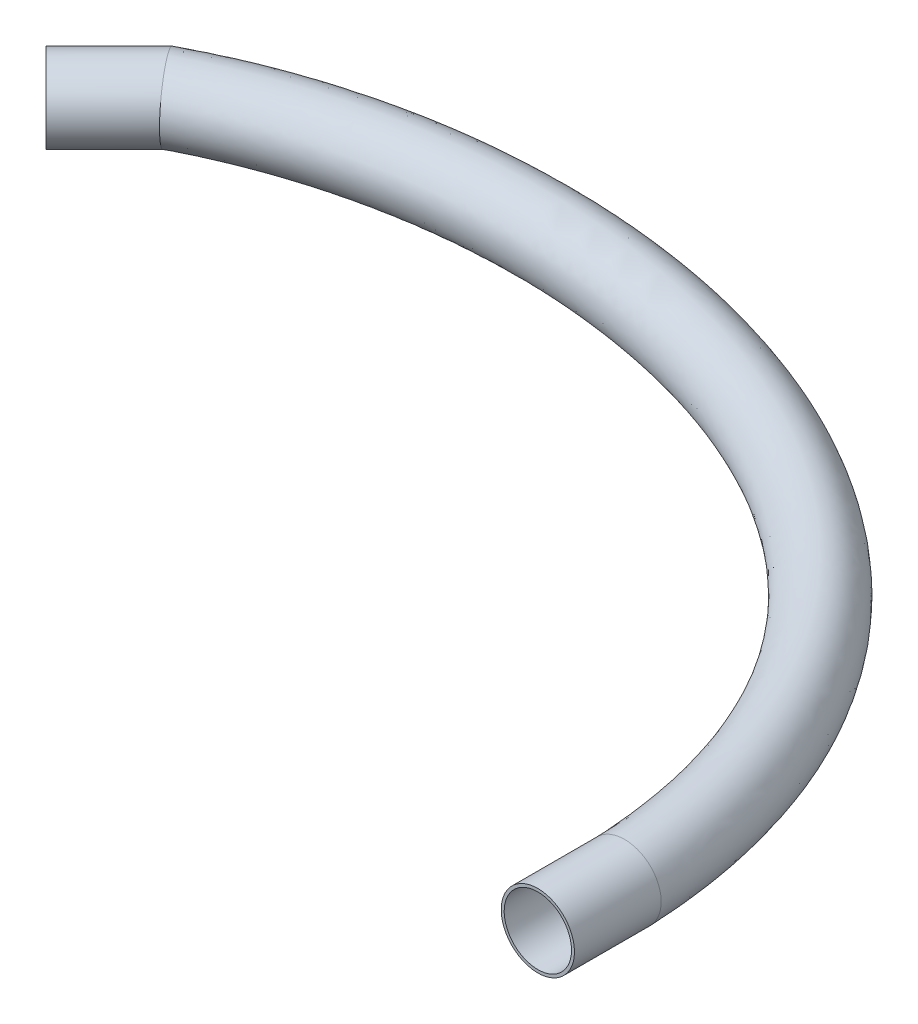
ISO-10303-21;
HEADER;
FILE_DESCRIPTION(('STEP AP214'),'2;1');
FILE_NAME('part.step','',(''),(''),'','','');
FILE_SCHEMA(('AUTOMOTIVE_DESIGN { 1 0 10303 214 1 1 1 1 }'));
ENDSEC;
DATA;
#1=APPLICATION_CONTEXT('core data for automotive mechanical design processes');
#2=APPLICATION_PROTOCOL_DEFINITION('international standard','automotive_design',2000,#1);
#3=PRODUCT_CONTEXT('',#1,'mechanical');
#4=PRODUCT('Part','Part','',(#3));
#5=PRODUCT_RELATED_PRODUCT_CATEGORY('part','',(#4));
#6=PRODUCT_DEFINITION_FORMATION('','',#4);
#7=PRODUCT_DEFINITION_CONTEXT('part definition',#1,'design');
#8=PRODUCT_DEFINITION('design','',#6,#7);
#9=PRODUCT_DEFINITION_SHAPE('','',#8);
#10=(LENGTH_UNIT() NAMED_UNIT(*) SI_UNIT(.MILLI.,.METRE.));
#11=(NAMED_UNIT(*) PLANE_ANGLE_UNIT() SI_UNIT($,.RADIAN.));
#12=(NAMED_UNIT(*) SI_UNIT($,.STERADIAN.) SOLID_ANGLE_UNIT());
#13=UNCERTAINTY_MEASURE_WITH_UNIT(LENGTH_MEASURE(1.E-05),#10,'distance_accuracy_value','');
#14=(GEOMETRIC_REPRESENTATION_CONTEXT(3) GLOBAL_UNCERTAINTY_ASSIGNED_CONTEXT((#13)) GLOBAL_UNIT_ASSIGNED_CONTEXT((#10,
#11,#12)) REPRESENTATION_CONTEXT('',''));
#15=CARTESIAN_POINT('',(0.,0.,0.));
#16=DIRECTION('',(0.,0.,1.));
#17=DIRECTION('',(1.,0.,0.));
#18=AXIS2_PLACEMENT_3D('',#15,#16,#17);
#19=CARTESIAN_POINT('',(-351.314661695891,11.3802017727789,-129.287591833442));
#20=DIRECTION('',(-0.707106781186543,0.,0.707106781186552));
#21=DIRECTION('',(0.707106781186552,0.,0.707106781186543));
#22=AXIS2_PLACEMENT_3D('',#19,#20,#21);
#23=CYLINDRICAL_SURFACE('',#22,21.75);
#24=CARTESIAN_POINT('',(-353.946484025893,-10.3697982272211,-126.655769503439));
#25=CARTESIAN_POINT('',(-353.935762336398,-10.3697982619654,-126.641222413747));
#26=CARTESIAN_POINT('',(-353.925040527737,-10.3697762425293,-126.626674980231));
#27=CARTESIAN_POINT('',(-353.544874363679,-10.3682136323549,-126.110856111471));
#28=CARTESIAN_POINT('',(-353.175337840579,-10.3405141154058,-125.609243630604));
#29=CARTESIAN_POINT('',(-352.623284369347,-10.2598593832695,-124.859559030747));
#30=CARTESIAN_POINT('',(-352.439564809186,-10.2264345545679,-124.610015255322));
#31=CARTESIAN_POINT('',(-352.073123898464,-10.1465888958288,-124.11217630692));
#32=CARTESIAN_POINT('',(-351.89040275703,-10.1001654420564,-123.863881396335));
#33=CARTESIAN_POINT('',(-351.343440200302,-9.94125587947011,-123.120467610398));
#34=CARTESIAN_POINT('',(-350.981207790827,-9.80924863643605,-122.627917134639));
#35=CARTESIAN_POINT('',(-350.264820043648,-9.49414440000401,-121.653380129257));
#36=CARTESIAN_POINT('',(-349.910664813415,-9.31104672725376,-121.171393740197));
#37=CARTESIAN_POINT('',(-349.387593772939,-8.99915976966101,-120.459224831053));
#38=CARTESIAN_POINT('',(-349.214642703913,-8.88902550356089,-120.223699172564));
#39=CARTESIAN_POINT('',(-348.871739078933,-8.65654259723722,-119.756636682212));
#40=CARTESIAN_POINT('',(-348.701785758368,-8.53419712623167,-119.525098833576));
#41=CARTESIAN_POINT('',(-348.196769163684,-8.14905770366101,-118.836944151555));
#42=CARTESIAN_POINT('',(-347.866532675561,-7.86815085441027,-118.386763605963));
#43=CARTESIAN_POINT('',(-347.221754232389,-7.26030097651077,-117.507456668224));
#44=CARTESIAN_POINT('',(-346.907201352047,-6.93339061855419,-117.07831562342));
#45=CARTESIAN_POINT('',(-346.295769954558,-6.23558493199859,-116.243839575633));
#46=CARTESIAN_POINT('',(-345.998891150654,-5.86469031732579,-115.83850418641));
#47=CARTESIAN_POINT('',(-345.426333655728,-5.08331427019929,-115.056508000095));
#48=CARTESIAN_POINT('',(-345.150562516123,-4.67302560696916,-114.679722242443));
#49=CARTESIAN_POINT('',(-344.620713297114,-3.81425439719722,-113.955558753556));
#50=CARTESIAN_POINT('',(-344.366635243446,-3.36577180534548,-113.608181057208));
#51=CARTESIAN_POINT('',(-343.882035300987,-2.43371156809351,-112.945438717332));
#52=CARTESIAN_POINT('',(-343.651515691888,-1.95013053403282,-112.630077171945));
#53=CARTESIAN_POINT('',(-343.215790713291,-0.951343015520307,-112.033829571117));
#54=CARTESIAN_POINT('',(-343.010585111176,-0.436136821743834,-111.752943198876));
#55=CARTESIAN_POINT('',(-342.629180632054,0.616304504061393,-111.230755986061));
#56=CARTESIAN_POINT('',(-342.452684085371,1.15323029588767,-110.989049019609));
#57=CARTESIAN_POINT('',(-342.127286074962,2.25058126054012,-110.543340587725));
#58=CARTESIAN_POINT('',(-341.978384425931,2.81100627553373,-110.339338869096));
#59=CARTESIAN_POINT('',(-341.709311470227,3.95129803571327,-109.970640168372));
#60=CARTESIAN_POINT('',(-341.589138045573,4.53116334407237,-109.80594028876));
#61=CARTESIAN_POINT('',(-341.37842352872,5.70618261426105,-109.517118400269));
#62=CARTESIAN_POINT('',(-341.287882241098,6.30133647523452,-109.392996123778));
#63=CARTESIAN_POINT('',(-341.137933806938,7.49615925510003,-109.18741706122));
#64=CARTESIAN_POINT('',(-341.078203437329,8.09571145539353,-109.105517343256));
#65=CARTESIAN_POINT('',(-340.988872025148,9.30124400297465,-108.983025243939));
#66=CARTESIAN_POINT('',(-340.95927075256,9.90722430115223,-108.942432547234));
#67=CARTESIAN_POINT('',(-340.930421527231,11.1212422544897,-108.902871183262));
#68=CARTESIAN_POINT('',(-340.93117257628,11.7292798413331,-108.903901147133));
#69=CARTESIAN_POINT('',(-340.963019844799,12.943061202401,-108.94757368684));
#70=CARTESIAN_POINT('',(-340.994116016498,13.5488049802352,-108.990216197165));
#71=CARTESIAN_POINT('',(-341.08617681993,14.750500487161,-109.116450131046));
#72=CARTESIAN_POINT('',(-341.146984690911,15.3464868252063,-109.199826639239));
#73=CARTESIAN_POINT('',(-341.297942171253,16.5276605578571,-109.40678732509));
#74=CARTESIAN_POINT('',(-341.388091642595,17.1128480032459,-109.530371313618));
#75=CARTESIAN_POINT('',(-341.597064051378,18.2683080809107,-109.816803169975));
#76=CARTESIAN_POINT('',(-341.715887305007,18.838580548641,-109.979651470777));
#77=CARTESIAN_POINT('',(-341.981330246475,19.9602147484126,-110.34337464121));
#78=CARTESIAN_POINT('',(-342.12795003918,20.5115764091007,-110.544249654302));
#79=CARTESIAN_POINT('',(-342.448362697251,21.5930802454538,-110.983130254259));
#80=CARTESIAN_POINT('',(-342.622230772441,22.1231584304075,-111.221238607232));
#81=CARTESIAN_POINT('',(-342.995571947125,23.1567854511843,-111.732390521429));
#82=CARTESIAN_POINT('',(-343.195045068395,23.6603342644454,-112.005434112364));
#83=CARTESIAN_POINT('',(-343.618144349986,24.6374342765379,-112.584417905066));
#84=CARTESIAN_POINT('',(-343.841769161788,25.1109871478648,-112.890356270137));
#85=CARTESIAN_POINT('',(-344.311582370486,26.0249268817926,-113.532901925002));
#86=CARTESIAN_POINT('',(-344.557770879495,26.4653135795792,-113.869509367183));
#87=CARTESIAN_POINT('',(-345.073328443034,27.3138553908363,-114.574181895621));
#88=CARTESIAN_POINT('',(-345.342889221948,27.7216782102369,-114.942506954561));
#89=CARTESIAN_POINT('',(-345.901291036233,28.4978047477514,-115.705226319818));
#90=CARTESIAN_POINT('',(-346.19013232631,28.8661079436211,-116.099620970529));
#91=CARTESIAN_POINT('',(-346.78525805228,29.5609628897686,-116.911919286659));
#92=CARTESIAN_POINT('',(-347.09155115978,29.8874936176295,-117.329834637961));
#93=CARTESIAN_POINT('',(-347.562233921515,30.3440837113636,-117.971794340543));
#94=CARTESIAN_POINT('',(-347.721007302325,30.4907502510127,-118.188302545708));
#95=CARTESIAN_POINT('',(-348.042098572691,30.7728542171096,-118.626065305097));
#96=CARTESIAN_POINT('',(-348.204417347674,30.9082887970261,-118.847321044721));
#97=CARTESIAN_POINT('',(-348.700182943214,31.300478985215,-119.5229604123));
#98=CARTESIAN_POINT('',(-349.038680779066,31.5394727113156,-119.984090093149));
#99=CARTESIAN_POINT('',(-349.726514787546,31.9687237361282,-120.920720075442));
#100=CARTESIAN_POINT('',(-350.075850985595,32.1589809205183,-121.396220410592));
#101=CARTESIAN_POINT('',(-350.605802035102,32.4067386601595,-122.117251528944));
#102=CARTESIAN_POINT('',(-350.783325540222,32.4830156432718,-122.358731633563));
#103=CARTESIAN_POINT('',(-351.140106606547,32.6229822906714,-122.843945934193));
#104=CARTESIAN_POINT('',(-351.319363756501,32.6866748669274,-123.087679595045));
#105=CARTESIAN_POINT('',(-351.859203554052,32.8586819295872,-123.821534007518));
#106=CARTESIAN_POINT('',(-352.222073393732,32.9480280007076,-124.314605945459));
#107=CARTESIAN_POINT('',(-352.807059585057,33.0502733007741,-125.109150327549));
#108=CARTESIAN_POINT('',(-353.028183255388,33.079427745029,-125.409408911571));
#109=CARTESIAN_POINT('',(-353.470974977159,33.1188967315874,-126.010509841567));
#110=CARTESIAN_POINT('',(-353.692642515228,33.1292249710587,-126.311351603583));
#111=CARTESIAN_POINT('',(-353.925040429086,33.1301797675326,-126.626674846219));
#112=CARTESIAN_POINT('',(-353.935762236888,33.1302017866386,-126.641222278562));
#113=CARTESIAN_POINT('',(-353.946484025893,33.1302017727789,-126.655769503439));
#114=B_SPLINE_CURVE_WITH_KNOTS('',3,(#24,#25,#26,#27,#28,#29,#30,#31,#32,#33,#34,#35,#36,#37,
#38,#39,#40,#41,#42,#43,#44,#45,#46,#47,#48,#49,#50,#51,#52,#53,#54,#55,#56,#57,#58,#59,#60,#61,
#62,#63,#64,#65,#66,#67,#68,#69,#70,#71,#72,#73,#74,#75,#76,#77,#78,#79,#80,#81,#82,#83,#84,#85,
#86,#87,#88,#89,#90,#91,#92,#93,#94,#95,#96,#97,#98,#99,#100,#101,#102,#103,#104,#105,#106,#107,
#108,#109,#110,#111,#112,#113),.UNSPECIFIED.,.F.,.F.,(4,2,2,2,2,2,2,2,2,2,2,2,2,2,2,2,2,2,2,2,2,
2,2,2,2,2,2,2,2,2,2,2,2,2,2,2,2,2,2,2,2,2,2,2,4),(0.,0.0542149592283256,1.92230102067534,
2.85713237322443,3.79215255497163,5.66628354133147,7.54043944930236,8.47701126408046,
9.41334063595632,11.2859105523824,13.1571572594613,15.0283735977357,16.8908596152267,
18.7533478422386,20.6160161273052,22.4786672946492,24.3205684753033,26.1624572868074,
28.0042102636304,29.8459510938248,31.6679566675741,33.4899483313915,35.311880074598,
37.1338089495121,38.946227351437,40.75863722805,42.5710670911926,44.3835037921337,
46.2010342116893,48.0185661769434,49.8359967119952,51.6534362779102,53.4875281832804,
55.3216443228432,57.1566798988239,58.0742565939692,58.9920651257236,60.8495988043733,
62.7071368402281,63.6346941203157,64.5620365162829,66.4155745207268,67.5373012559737,
68.6582115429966,68.7124265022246),.UNSPECIFIED.);
#115=CARTESIAN_POINT('',(-353.946484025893,-10.3697982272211,-126.655769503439));
#116=VERTEX_POINT('',#115);
#117=CARTESIAN_POINT('',(-353.946484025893,33.1302017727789,-126.655769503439));
#118=VERTEX_POINT('',#117);
#119=EDGE_CURVE('E62',#116,#118,#114,.T.);
#120=ORIENTED_EDGE('',*,*,#119,.T.);
#121=CARTESIAN_POINT('',(-353.946484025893,-10.3697982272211,-126.655769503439));
#122=CARTESIAN_POINT('',(-353.957205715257,-10.3697982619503,-126.67031659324));
#123=CARTESIAN_POINT('',(-353.96792761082,-10.3697762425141,-126.684863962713));
#124=CARTESIAN_POINT('',(-354.347926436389,-10.3682143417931,-127.200442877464));
#125=CARTESIAN_POINT('',(-354.717398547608,-10.3405399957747,-127.701739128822));
#126=CARTESIAN_POINT('',(-355.269510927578,-10.2599521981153,-128.450839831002));
#127=CARTESIAN_POINT('',(-355.453276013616,-10.2265545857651,-128.700170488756));
#128=CARTESIAN_POINT('',(-355.819859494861,-10.1467718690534,-129.197547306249));
#129=CARTESIAN_POINT('',(-356.002677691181,-10.1003841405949,-129.445593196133));
#130=CARTESIAN_POINT('',(-356.550007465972,-9.94159315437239,-130.188204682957));
#131=CARTESIAN_POINT('',(-356.912586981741,-9.80967991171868,-130.68014883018));
#132=CARTESIAN_POINT('',(-357.629862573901,-9.49478438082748,-131.653340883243));
#133=CARTESIAN_POINT('',(-357.984558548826,-9.3118014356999,-132.134588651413));
#134=CARTESIAN_POINT('',(-358.508573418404,-9.00009491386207,-132.845566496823));
#135=CARTESIAN_POINT('',(-358.681862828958,-8.89002085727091,-133.080683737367));
#136=CARTESIAN_POINT('',(-359.025482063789,-8.65766085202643,-133.546902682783));
#137=CARTESIAN_POINT('',(-359.195812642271,-8.53537807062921,-133.778005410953));
#138=CARTESIAN_POINT('',(-359.702015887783,-8.15042972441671,-134.464816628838));
#139=CARTESIAN_POINT('',(-360.033116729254,-7.86965424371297,-134.914050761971));
#140=CARTESIAN_POINT('',(-360.679740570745,-7.26207359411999,-135.791383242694));
#141=CARTESIAN_POINT('',(-360.995274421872,-6.93530111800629,-136.219496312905));
#142=CARTESIAN_POINT('',(-361.608752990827,-6.23777880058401,-137.051857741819));
#143=CARTESIAN_POINT('',(-361.906697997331,-5.86702968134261,-137.456106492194));
#144=CARTESIAN_POINT('',(-362.481353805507,-5.08606410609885,-138.235793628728));
#145=CARTESIAN_POINT('',(-362.758162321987,-4.676051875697,-138.611364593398));
#146=CARTESIAN_POINT('',(-363.290116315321,-3.81786922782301,-139.333114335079));
#147=CARTESIAN_POINT('',(-363.545261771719,-3.36969877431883,-139.679293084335));
#148=CARTESIAN_POINT('',(-364.031995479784,-2.43830007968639,-140.339688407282));
#149=CARTESIAN_POINT('',(-364.263581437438,-1.95506843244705,-140.65390186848));
#150=CARTESIAN_POINT('',(-364.701408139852,-0.957017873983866,-141.247940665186));
#151=CARTESIAN_POINT('',(-364.907649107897,-0.442199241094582,-141.527766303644));
#152=CARTESIAN_POINT('',(-365.291110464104,0.609587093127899,-142.048042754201));
#153=CARTESIAN_POINT('',(-365.46862148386,1.14625382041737,-142.288887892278));
#154=CARTESIAN_POINT('',(-365.795951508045,2.24306676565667,-142.733005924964));
#155=CARTESIAN_POINT('',(-365.945770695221,2.80321282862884,-142.936279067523));
#156=CARTESIAN_POINT('',(-366.216561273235,3.94293236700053,-143.303684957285));
#157=CARTESIAN_POINT('',(-366.337534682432,4.52250447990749,-143.467820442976));
#158=CARTESIAN_POINT('',(-366.549713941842,5.69692757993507,-143.75570309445));
#159=CARTESIAN_POINT('',(-366.6409199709,6.29177847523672,-143.879450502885));
#160=CARTESIAN_POINT('',(-366.792098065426,7.48643318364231,-144.084567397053));
#161=CARTESIAN_POINT('',(-366.852373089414,8.08612813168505,-144.16634793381));
#162=CARTESIAN_POINT('',(-366.942594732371,9.29196296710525,-144.288759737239));
#163=CARTESIAN_POINT('',(-366.972541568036,9.89810280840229,-144.329391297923));
#164=CARTESIAN_POINT('',(-367.001877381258,11.1124615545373,-144.369193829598));
#165=CARTESIAN_POINT('',(-367.001267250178,11.7206803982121,-144.368366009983));
#166=CARTESIAN_POINT('',(-366.96949601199,12.934846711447,-144.325259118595));
#167=CARTESIAN_POINT('',(-366.938334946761,13.5407941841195,-144.282980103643));
#168=CARTESIAN_POINT('',(-366.845921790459,14.7431949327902,-144.157594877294));
#169=CARTESIAN_POINT('',(-366.784813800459,15.3396796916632,-144.074684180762));
#170=CARTESIAN_POINT('',(-366.633036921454,16.5218637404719,-143.868754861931));
#171=CARTESIAN_POINT('',(-366.542368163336,17.1075630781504,-143.74573641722));
#172=CARTESIAN_POINT('',(-366.332152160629,18.2640490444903,-143.460517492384));
#173=CARTESIAN_POINT('',(-366.212604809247,18.8348356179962,-143.298316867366));
#174=CARTESIAN_POINT('',(-365.945526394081,19.9574953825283,-142.935947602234));
#175=CARTESIAN_POINT('',(-365.797995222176,20.5093685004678,-142.73577881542));
#176=CARTESIAN_POINT('',(-365.475636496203,21.591734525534,-142.298405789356));
#177=CARTESIAN_POINT('',(-365.300740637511,22.1221696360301,-142.06110887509));
#178=CARTESIAN_POINT('',(-364.925219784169,23.1564968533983,-141.551606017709));
#179=CARTESIAN_POINT('',(-364.72459481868,23.6603889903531,-141.279400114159));
#180=CARTESIAN_POINT('',(-364.299091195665,24.6381648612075,-140.702081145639));
#181=CARTESIAN_POINT('',(-364.074213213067,25.1120494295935,-140.396968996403));
#182=CARTESIAN_POINT('',(-363.601830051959,26.0266149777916,-139.756044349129));
#183=CARTESIAN_POINT('',(-363.354324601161,26.4672955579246,-139.420231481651));
#184=CARTESIAN_POINT('',(-362.833312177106,27.3209299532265,-138.71332714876));
#185=CARTESIAN_POINT('',(-362.559385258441,27.7331560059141,-138.341665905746));
#186=CARTESIAN_POINT('',(-361.991866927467,28.5171460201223,-137.571662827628));
#187=CARTESIAN_POINT('',(-361.698275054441,28.888909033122,-137.173320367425));
#188=CARTESIAN_POINT('',(-361.093365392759,29.5896586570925,-136.352585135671));
#189=CARTESIAN_POINT('',(-360.782038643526,29.9186233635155,-135.930180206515));
#190=CARTESIAN_POINT('',(-360.303686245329,30.3780347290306,-135.281156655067));
#191=CARTESIAN_POINT('',(-360.142336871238,30.5255030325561,-135.062239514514));
#192=CARTESIAN_POINT('',(-359.816065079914,30.8089295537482,-134.619557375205));
#193=CARTESIAN_POINT('',(-359.651141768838,30.9448848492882,-134.395791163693));
#194=CARTESIAN_POINT('',(-359.151420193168,31.3351363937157,-133.717774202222));
#195=CARTESIAN_POINT('',(-358.811704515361,31.5717854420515,-133.256851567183));
#196=CARTESIAN_POINT('',(-358.121714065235,31.996310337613,-132.320679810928));
#197=CARTESIAN_POINT('',(-357.771439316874,32.1841862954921,-131.845430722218));
#198=CARTESIAN_POINT('',(-357.24031966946,32.4283585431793,-131.124813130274));
#199=CARTESIAN_POINT('',(-357.062452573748,32.5034370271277,-130.883484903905));
#200=CARTESIAN_POINT('',(-356.705061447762,32.6410081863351,-130.398580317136));
#201=CARTESIAN_POINT('',(-356.525537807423,32.7035037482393,-130.155004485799));
#202=CARTESIAN_POINT('',(-355.985017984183,32.8719262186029,-129.421632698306));
#203=CARTESIAN_POINT('',(-355.621851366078,32.958890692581,-128.928891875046));
#204=CARTESIAN_POINT('',(-355.044778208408,33.0559791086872,-128.145924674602));
#205=CARTESIAN_POINT('',(-354.831797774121,33.0830238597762,-127.8569548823));
#206=CARTESIAN_POINT('',(-354.405419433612,33.1196577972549,-127.27844880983));
#207=CARTESIAN_POINT('',(-354.192021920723,33.1292591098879,-126.988913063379));
#208=CARTESIAN_POINT('',(-353.967927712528,33.1301797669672,-126.684864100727));
#209=CARTESIAN_POINT('',(-353.95720581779,33.1302017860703,-126.670316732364));
#210=CARTESIAN_POINT('',(-353.946484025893,33.1302017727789,-126.655769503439));
#211=B_SPLINE_CURVE_WITH_KNOTS('',3,(#121,#122,#123,#124,#125,#126,#127,#128,#129,#130,#131,
#132,#133,#134,#135,#136,#137,#138,#139,#140,#141,#142,#143,#144,#145,#146,#147,#148,#149,#150,
#151,#152,#153,#154,#155,#156,#157,#158,#159,#160,#161,#162,#163,#164,#165,#166,#167,#168,#169,
#170,#171,#172,#173,#174,#175,#176,#177,#178,#179,#180,#181,#182,#183,#184,#185,#186,#187,#188,
#189,#190,#191,#192,#193,#194,#195,#196,#197,#198,#199,#200,#201,#202,#203,#204,#205,#206,#207,
#208,#209,#210),.UNSPECIFIED.,.F.,.F.,(4,2,2,2,2,2,2,2,2,2,2,2,2,2,2,2,2,2,2,2,2,2,2,2,2,2,2,2,
2,2,2,2,2,2,2,2,2,2,2,2,2,2,2,2,4),(0.,0.054214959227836,1.9214237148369,2.85581518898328,
3.79039555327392,5.66364002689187,7.5369085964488,8.47305601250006,9.40896119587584,
11.2806824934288,13.1510801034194,15.0214470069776,16.8825652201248,18.7436851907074,
20.6049862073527,22.4662708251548,24.3073576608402,26.1484323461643,27.9893781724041,
29.8303129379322,31.6528546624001,33.4753833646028,35.2978589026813,37.1203319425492,
38.9341203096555,40.747900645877,42.5616876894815,44.3754817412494,46.1938776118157,
48.0122714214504,49.8306146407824,51.648979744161,53.5035899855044,55.3582436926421,
57.2138429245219,58.1416965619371,59.0697849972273,60.92616040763,62.7825316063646,
63.7094456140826,64.6361467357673,66.4883914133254,67.5680466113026,68.6469509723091,
68.701165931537),.UNSPECIFIED.);
#212=EDGE_CURVE('E19',#116,#118,#211,.T.);
#213=ORIENTED_EDGE('',*,*,#212,.F.);
#214=EDGE_LOOP('',(#120,#213));
#215=FACE_BOUND('',#214,.T.);
#216=CARTESIAN_POINT('',(-390.008929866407,11.3802017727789,-90.5933236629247));
#217=DIRECTION('',(0.707106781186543,0.,-0.707106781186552));
#218=DIRECTION('',(-0.707106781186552,0.,-0.707106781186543));
#219=AXIS2_PLACEMENT_3D('',#216,#217,#218);
#220=CIRCLE('',#219,21.75);
#221=CARTESIAN_POINT('',(-405.388502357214,11.3802017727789,-105.972896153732));
#222=VERTEX_POINT('',#221);
#223=EDGE_CURVE('E34',#222,#222,#220,.T.);
#224=ORIENTED_EDGE('',*,*,#223,.T.);
#225=EDGE_LOOP('',(#224));
#226=FACE_BOUND('',#225,.T.);
#227=ADVANCED_FACE('F16',(#215,#226),#23,.T.);
#228=CARTESIAN_POINT('',(206.310943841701,11.3802017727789,140.468204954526));
#229=CARTESIAN_POINT('',(206.299904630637,11.3802017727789,140.241277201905));
#230=CARTESIAN_POINT('',(206.28919457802,11.3802017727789,140.021112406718));
#231=CARTESIAN_POINT('',(206.250770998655,11.3802017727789,139.23126883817));
#232=CARTESIAN_POINT('',(206.220907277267,11.3802017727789,138.64357441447));
#233=CARTESIAN_POINT('',(206.160263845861,11.3802017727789,137.501676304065));
#234=CARTESIAN_POINT('',(206.128701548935,11.3802017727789,136.931377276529));
#235=CARTESIAN_POINT('',(206.030301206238,11.3802017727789,135.222433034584));
#236=CARTESIAN_POINT('',(205.959749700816,11.3802017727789,134.085740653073));
#237=CARTESIAN_POINT('',(205.733307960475,11.3802017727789,130.683497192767));
#238=CARTESIAN_POINT('',(205.562630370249,11.3802017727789,128.425779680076));
#239=CARTESIAN_POINT('',(204.991985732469,11.3802017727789,121.684144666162));
#240=CARTESIAN_POINT('',(204.533404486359,11.3802017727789,117.231743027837));
#241=CARTESIAN_POINT('',(202.927584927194,11.3802017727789,104.002132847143));
#242=CARTESIAN_POINT('',(201.550227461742,11.3802017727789,95.3525016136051));
#243=CARTESIAN_POINT('',(196.534190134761,11.3802017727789,69.9269851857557));
#244=CARTESIAN_POINT('',(192.010785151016,11.3802017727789,53.6745678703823));
#245=CARTESIAN_POINT('',(175.220308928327,11.3802017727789,7.11970683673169));
#246=CARTESIAN_POINT('',(159.727380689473,11.3802017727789,-20.9690956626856));
#247=CARTESIAN_POINT('',(122.062942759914,11.3802017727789,-70.8163960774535));
#248=CARTESIAN_POINT('',(99.9025274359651,11.3802017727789,-92.5771092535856));
#249=CARTESIAN_POINT('',(50.8561751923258,11.3802017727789,-129.648465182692));
#250=CARTESIAN_POINT('',(23.9711203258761,11.3802017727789,-144.966586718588));
#251=CARTESIAN_POINT('',(-32.7609015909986,11.3802017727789,-169.173369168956));
#252=CARTESIAN_POINT('',(-62.6107829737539,11.3802017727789,-178.065127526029));
#253=CARTESIAN_POINT('',(-123.639187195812,11.3802017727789,-189.400259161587));
#254=CARTESIAN_POINT('',(-154.820033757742,11.3802017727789,-191.844230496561));
#255=CARTESIAN_POINT('',(-216.918323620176,11.3802017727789,-190.17939924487));
#256=CARTESIAN_POINT('',(-247.838055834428,11.3802017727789,-186.07039541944));
#257=CARTESIAN_POINT('',(-292.808019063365,11.3802017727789,-174.848391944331));
#258=CARTESIAN_POINT('',(-307.56267976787,11.3802017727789,-170.263950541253));
#259=CARTESIAN_POINT('',(-329.183279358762,11.3802017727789,-162.09901991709));
#260=CARTESIAN_POINT('',(-336.304852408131,11.3802017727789,-159.16264117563));
#261=CARTESIAN_POINT('',(-346.838818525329,11.3802017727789,-154.433047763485));
#262=CARTESIAN_POINT('',(-350.325403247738,11.3802017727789,-152.802345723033));
#263=CARTESIAN_POINT('',(-355.515569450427,11.3802017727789,-150.274675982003));
#264=CARTESIAN_POINT('',(-357.239006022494,11.3802017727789,-149.418516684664));
#265=CARTESIAN_POINT('',(-359.813903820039,11.3802017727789,-148.113829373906));
#266=CARTESIAN_POINT('',(-360.670493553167,11.3802017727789,-147.675525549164));
#267=CARTESIAN_POINT('',(-361.952772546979,11.3802017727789,-147.012952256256));
#268=CARTESIAN_POINT('',(-362.379764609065,11.3802017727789,-146.791241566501));
#269=CARTESIAN_POINT('',(-363.23287329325,11.3802017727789,-146.346113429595));
#270=CARTESIAN_POINT('',(-363.671801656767,11.3802017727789,-146.115945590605));
#271=CARTESIAN_POINT('',(-364.651056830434,11.3802017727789,-145.600016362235));
#272=CARTESIAN_POINT('',(-365.182295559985,11.3802017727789,-145.320127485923));
#273=CARTESIAN_POINT('',(-366.279925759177,11.3802017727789,-144.741830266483));
#274=CARTESIAN_POINT('',(-366.828740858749,11.3802017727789,-144.452681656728));
#275=CARTESIAN_POINT('',(-367.377555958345,11.3802017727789,-144.163533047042));
#276=CARTESIAN_POINT('',(206.310943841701,54.8802017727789,140.468204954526));
#277=CARTESIAN_POINT('',(206.299904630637,54.8802017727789,140.241277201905));
#278=CARTESIAN_POINT('',(206.28919457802,54.8802017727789,140.021112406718));
#279=CARTESIAN_POINT('',(206.250770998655,54.8802017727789,139.23126883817));
#280=CARTESIAN_POINT('',(206.220907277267,54.8802017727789,138.64357441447));
#281=CARTESIAN_POINT('',(206.160263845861,54.8802017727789,137.501676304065));
#282=CARTESIAN_POINT('',(206.128701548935,54.8802017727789,136.931377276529));
#283=CARTESIAN_POINT('',(206.030301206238,54.8802017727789,135.222433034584));
#284=CARTESIAN_POINT('',(205.959749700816,54.8802017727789,134.085740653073));
#285=CARTESIAN_POINT('',(205.733307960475,54.8802017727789,130.683497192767));
#286=CARTESIAN_POINT('',(205.562630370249,54.8802017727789,128.425779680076));
#287=CARTESIAN_POINT('',(204.991985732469,54.8802017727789,121.684144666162));
#288=CARTESIAN_POINT('',(204.533404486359,54.8802017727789,117.231743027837));
#289=CARTESIAN_POINT('',(202.927584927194,54.8802017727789,104.002132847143));
#290=CARTESIAN_POINT('',(201.550227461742,54.8802017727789,95.3525016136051));
#291=CARTESIAN_POINT('',(196.534190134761,54.8802017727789,69.9269851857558));
#292=CARTESIAN_POINT('',(192.010785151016,54.8802017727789,53.6745678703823));
#293=CARTESIAN_POINT('',(175.220308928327,54.8802017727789,7.11970683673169));
#294=CARTESIAN_POINT('',(159.727380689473,54.8802017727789,-20.9690956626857));
#295=CARTESIAN_POINT('',(122.062942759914,54.8802017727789,-70.8163960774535));
#296=CARTESIAN_POINT('',(99.9025274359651,54.8802017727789,-92.5771092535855));
#297=CARTESIAN_POINT('',(50.8561751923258,54.8802017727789,-129.648465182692));
#298=CARTESIAN_POINT('',(23.9711203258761,54.8802017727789,-144.966586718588));
#299=CARTESIAN_POINT('',(-32.7609015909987,54.8802017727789,-169.173369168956));
#300=CARTESIAN_POINT('',(-62.6107829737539,54.8802017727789,-178.065127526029));
#301=CARTESIAN_POINT('',(-123.639187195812,54.8802017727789,-189.400259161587));
#302=CARTESIAN_POINT('',(-154.820033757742,54.8802017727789,-191.844230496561));
#303=CARTESIAN_POINT('',(-216.918323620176,54.8802017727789,-190.17939924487));
#304=CARTESIAN_POINT('',(-247.838055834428,54.8802017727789,-186.07039541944));
#305=CARTESIAN_POINT('',(-292.808019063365,54.8802017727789,-174.848391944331));
#306=CARTESIAN_POINT('',(-307.56267976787,54.8802017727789,-170.263950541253));
#307=CARTESIAN_POINT('',(-329.183279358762,54.8802017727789,-162.09901991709));
#308=CARTESIAN_POINT('',(-336.304852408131,54.8802017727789,-159.16264117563));
#309=CARTESIAN_POINT('',(-346.838818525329,54.8802017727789,-154.433047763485));
#310=CARTESIAN_POINT('',(-350.325403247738,54.8802017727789,-152.802345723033));
#311=CARTESIAN_POINT('',(-355.515569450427,54.8802017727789,-150.274675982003));
#312=CARTESIAN_POINT('',(-357.239006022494,54.8802017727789,-149.418516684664));
#313=CARTESIAN_POINT('',(-359.813903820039,54.8802017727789,-148.113829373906));
#314=CARTESIAN_POINT('',(-360.670493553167,54.8802017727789,-147.675525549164));
#315=CARTESIAN_POINT('',(-361.952772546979,54.8802017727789,-147.012952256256));
#316=CARTESIAN_POINT('',(-362.379764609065,54.8802017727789,-146.791241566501));
#317=CARTESIAN_POINT('',(-363.23287329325,54.8802017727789,-146.346113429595));
#318=CARTESIAN_POINT('',(-363.671801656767,54.8802017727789,-146.115945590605));
#319=CARTESIAN_POINT('',(-364.651056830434,54.8802017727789,-145.600016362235));
#320=CARTESIAN_POINT('',(-365.182295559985,54.8802017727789,-145.320127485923));
#321=CARTESIAN_POINT('',(-366.279925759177,54.8802017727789,-144.741830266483));
#322=CARTESIAN_POINT('',(-366.828740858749,54.8802017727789,-144.452681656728));
#323=CARTESIAN_POINT('',(-367.377555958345,54.8802017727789,-144.163533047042));
#324=CARTESIAN_POINT('',(162.862323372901,54.8802017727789,142.581822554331));
#325=CARTESIAN_POINT('',(162.851284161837,54.8802017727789,142.35489480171));
#326=CARTESIAN_POINT('',(162.839916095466,54.8802017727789,142.121203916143));
#327=CARTESIAN_POINT('',(162.803716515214,54.8802017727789,141.377076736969));
#328=CARTESIAN_POINT('',(162.778696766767,54.8802017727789,140.88600992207));
#329=CARTESIAN_POINT('',(162.724903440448,54.8802017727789,139.873097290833));
#330=CARTESIAN_POINT('',(162.696913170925,54.8802017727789,139.367346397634));
#331=CARTESIAN_POINT('',(162.609672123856,54.8802017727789,137.852208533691));
#332=CARTESIAN_POINT('',(162.547151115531,54.8802017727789,136.844936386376));
#333=CARTESIAN_POINT('',(162.346591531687,54.8802017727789,133.831567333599));
#334=CARTESIAN_POINT('',(162.19555652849,54.8802017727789,131.833917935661));
#335=CARTESIAN_POINT('',(161.691136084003,54.8802017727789,125.874660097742));
#336=CARTESIAN_POINT('',(161.286437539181,54.8802017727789,121.94674367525));
#337=CARTESIAN_POINT('',(159.872371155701,54.8802017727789,110.296899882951));
#338=CARTESIAN_POINT('',(158.663075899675,54.8802017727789,102.708895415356));
#339=CARTESIAN_POINT('',(154.276269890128,54.8802017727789,80.4728550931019));
#340=CARTESIAN_POINT('',(150.340599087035,54.8802017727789,66.3527017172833));
#341=CARTESIAN_POINT('',(135.800716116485,54.8802017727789,26.0380482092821));
#342=CARTESIAN_POINT('',(122.469229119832,54.8802017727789,1.87810440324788));
#343=CARTESIAN_POINT('',(89.9079989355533,54.8802017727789,-41.215315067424));
#344=CARTESIAN_POINT('',(70.6671613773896,54.8802017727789,-60.1465754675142));
#345=CARTESIAN_POINT('',(27.6323508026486,54.8802017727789,-92.6741480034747));
#346=CARTESIAN_POINT('',(3.8374957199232,54.8802017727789,-106.262981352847));
#347=CARTESIAN_POINT('',(-46.7707787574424,54.8802017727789,-127.856844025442));
#348=CARTESIAN_POINT('',(-73.5812838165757,54.8802017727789,-135.858775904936));
#349=CARTESIAN_POINT('',(-128.555948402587,54.8802017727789,-146.069514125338));
#350=CARTESIAN_POINT('',(-156.717784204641,54.8802017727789,-148.277722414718));
#351=CARTESIAN_POINT('',(-212.688974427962,54.8802017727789,-146.777156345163));
#352=CARTESIAN_POINT('',(-240.496039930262,54.8802017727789,-143.068583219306));
#353=CARTESIAN_POINT('',(-280.680724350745,54.8802017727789,-133.040719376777));
#354=CARTESIAN_POINT('',(-293.821688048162,54.8802017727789,-128.954621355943));
#355=CARTESIAN_POINT('',(-313.001433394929,54.8802017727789,-121.711469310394));
#356=CARTESIAN_POINT('',(-319.3061267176,54.8802017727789,-119.111441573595));
#357=CARTESIAN_POINT('',(-328.612136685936,54.8802017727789,-114.933182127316));
#358=CARTESIAN_POINT('',(-331.688973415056,54.8802017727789,-113.494059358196));
#359=CARTESIAN_POINT('',(-336.264252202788,54.8802017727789,-111.265846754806));
#360=CARTESIAN_POINT('',(-337.782682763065,54.8802017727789,-110.511521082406));
#361=CARTESIAN_POINT('',(-340.050059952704,54.8802017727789,-109.36265286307));
#362=CARTESIAN_POINT('',(-340.804140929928,54.8802017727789,-108.976800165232));
#363=CARTESIAN_POINT('',(-341.932661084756,54.8802017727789,-108.393676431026));
#364=CARTESIAN_POINT('',(-342.308400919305,54.8802017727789,-108.198577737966));
#365=CARTESIAN_POINT('',(-343.059007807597,54.8802017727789,-107.806932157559));
#366=CARTESIAN_POINT('',(-343.421062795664,54.8802017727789,-107.617135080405));
#367=CARTESIAN_POINT('',(-344.339541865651,54.8802017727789,-107.133226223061));
#368=CARTESIAN_POINT('',(-344.905932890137,54.8802017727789,-106.834817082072));
#369=CARTESIAN_POINT('',(-346.003563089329,54.8802017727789,-106.256519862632));
#370=CARTESIAN_POINT('',(-346.5523781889,54.8802017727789,-105.967371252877));
#371=CARTESIAN_POINT('',(-347.101193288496,54.8802017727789,-105.678222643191));
#372=CARTESIAN_POINT('',(162.862323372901,11.3802017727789,142.581822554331));
#373=CARTESIAN_POINT('',(162.851284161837,11.3802017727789,142.35489480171));
#374=CARTESIAN_POINT('',(162.839916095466,11.3802017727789,142.121203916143));
#375=CARTESIAN_POINT('',(162.803716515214,11.3802017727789,141.377076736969));
#376=CARTESIAN_POINT('',(162.778696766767,11.3802017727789,140.886009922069));
#377=CARTESIAN_POINT('',(162.724903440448,11.3802017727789,139.873097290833));
#378=CARTESIAN_POINT('',(162.696913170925,11.3802017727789,139.367346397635));
#379=CARTESIAN_POINT('',(162.609672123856,11.3802017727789,137.852208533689));
#380=CARTESIAN_POINT('',(162.547151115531,11.3802017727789,136.844936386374));
#381=CARTESIAN_POINT('',(162.346591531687,11.3802017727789,133.831567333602));
#382=CARTESIAN_POINT('',(162.19555652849,11.3802017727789,131.833917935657));
#383=CARTESIAN_POINT('',(161.691136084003,11.3802017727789,125.874660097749));
#384=CARTESIAN_POINT('',(161.286437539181,11.3802017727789,121.94674367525));
#385=CARTESIAN_POINT('',(159.872371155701,11.3802017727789,110.296899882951));
#386=CARTESIAN_POINT('',(158.663075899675,11.3802017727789,102.708895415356));
#387=CARTESIAN_POINT('',(154.276269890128,11.3802017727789,80.4728550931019));
#388=CARTESIAN_POINT('',(150.340599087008,11.3802017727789,66.3527017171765));
#389=CARTESIAN_POINT('',(135.800716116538,11.3802017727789,26.0380482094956));
#390=CARTESIAN_POINT('',(122.469229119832,11.3802017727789,1.87810440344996));
#391=CARTESIAN_POINT('',(89.9079989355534,11.3802017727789,-41.215315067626));
#392=CARTESIAN_POINT('',(70.6671613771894,11.3802017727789,-60.1465754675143));
#393=CARTESIAN_POINT('',(27.6323508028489,11.3802017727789,-92.6741480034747));
#394=CARTESIAN_POINT('',(3.83749572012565,11.3802017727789,-106.262981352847));
#395=CARTESIAN_POINT('',(-46.7707787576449,11.3802017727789,-127.856844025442));
#396=CARTESIAN_POINT('',(-73.5812838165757,11.3802017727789,-135.858775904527));
#397=CARTESIAN_POINT('',(-128.555948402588,11.3802017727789,-146.069514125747));
#398=CARTESIAN_POINT('',(-156.717784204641,11.3802017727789,-148.277722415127));
#399=CARTESIAN_POINT('',(-212.688974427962,11.3802017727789,-146.777156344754));
#400=CARTESIAN_POINT('',(-240.496039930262,11.3802017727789,-143.068583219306));
#401=CARTESIAN_POINT('',(-280.680724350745,11.3802017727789,-133.040719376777));
#402=CARTESIAN_POINT('',(-293.82168804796,11.3802017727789,-128.954621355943));
#403=CARTESIAN_POINT('',(-313.00143339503,11.3802017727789,-121.711469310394));
#404=CARTESIAN_POINT('',(-319.3061267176,11.3802017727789,-119.111441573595));
#405=CARTESIAN_POINT('',(-328.612136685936,11.3802017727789,-114.933182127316));
#406=CARTESIAN_POINT('',(-331.688973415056,11.3802017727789,-113.494059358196));
#407=CARTESIAN_POINT('',(-336.264252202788,11.3802017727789,-111.265846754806));
#408=CARTESIAN_POINT('',(-337.782682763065,11.3802017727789,-110.511521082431));
#409=CARTESIAN_POINT('',(-340.050059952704,11.3802017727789,-109.362652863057));
#410=CARTESIAN_POINT('',(-340.804140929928,11.3802017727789,-108.976800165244));
#411=CARTESIAN_POINT('',(-341.932661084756,11.3802017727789,-108.39367643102));
#412=CARTESIAN_POINT('',(-342.308400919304,11.3802017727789,-108.19857773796));
#413=CARTESIAN_POINT('',(-343.059007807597,11.3802017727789,-107.806932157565));
#414=CARTESIAN_POINT('',(-343.421062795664,11.3802017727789,-107.617135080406));
#415=CARTESIAN_POINT('',(-344.339541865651,11.3802017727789,-107.133226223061));
#416=CARTESIAN_POINT('',(-344.905932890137,11.3802017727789,-106.834817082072));
#417=CARTESIAN_POINT('',(-346.003563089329,11.3802017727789,-106.256519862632));
#418=CARTESIAN_POINT('',(-346.5523781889,11.3802017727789,-105.967371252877));
#419=CARTESIAN_POINT('',(-347.101193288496,11.3802017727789,-105.678222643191));
#420=CARTESIAN_POINT('',(162.862323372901,-32.1197982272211,142.581822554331));
#421=CARTESIAN_POINT('',(162.851284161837,-32.1197982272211,142.35489480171));
#422=CARTESIAN_POINT('',(162.839916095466,-32.1197982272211,142.121203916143));
#423=CARTESIAN_POINT('',(162.803716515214,-32.1197982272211,141.377076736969));
#424=CARTESIAN_POINT('',(162.778696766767,-32.1197982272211,140.886009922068));
#425=CARTESIAN_POINT('',(162.724903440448,-32.1197982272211,139.873097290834));
#426=CARTESIAN_POINT('',(162.696913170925,-32.1197982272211,139.367346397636));
#427=CARTESIAN_POINT('',(162.609672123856,-32.1197982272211,137.852208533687));
#428=CARTESIAN_POINT('',(162.547151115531,-32.1197982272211,136.844936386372));
#429=CARTESIAN_POINT('',(162.346591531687,-32.1197982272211,133.831567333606));
#430=CARTESIAN_POINT('',(162.19555652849,-32.1197982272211,131.833917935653));
#431=CARTESIAN_POINT('',(161.691136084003,-32.1197982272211,125.874660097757));
#432=CARTESIAN_POINT('',(161.286437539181,-32.1197982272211,121.94674367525));
#433=CARTESIAN_POINT('',(159.872371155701,-32.1197982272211,110.296899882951));
#434=CARTESIAN_POINT('',(158.663075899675,-32.1197982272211,102.708895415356));
#435=CARTESIAN_POINT('',(154.276269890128,-32.1197982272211,80.4728550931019));
#436=CARTESIAN_POINT('',(150.340599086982,-32.1197982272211,66.3527017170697));
#437=CARTESIAN_POINT('',(135.800716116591,-32.1197982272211,26.0380482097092));
#438=CARTESIAN_POINT('',(122.469229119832,-32.1197982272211,1.87810440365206));
#439=CARTESIAN_POINT('',(89.9079989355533,-32.1197982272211,-41.2153150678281));
#440=CARTESIAN_POINT('',(70.6671613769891,-32.1197982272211,-60.1465754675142));
#441=CARTESIAN_POINT('',(27.6323508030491,-32.1197982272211,-92.6741480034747));
#442=CARTESIAN_POINT('',(3.83749572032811,-32.1197982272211,-106.262981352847));
#443=CARTESIAN_POINT('',(-46.7707787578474,-32.1197982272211,-127.856844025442));
#444=CARTESIAN_POINT('',(-73.5812838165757,-32.1197982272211,-135.858775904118));
#445=CARTESIAN_POINT('',(-128.555948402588,-32.1197982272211,-146.069514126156));
#446=CARTESIAN_POINT('',(-156.717784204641,-32.1197982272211,-148.277722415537));
#447=CARTESIAN_POINT('',(-212.688974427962,-32.1197982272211,-146.777156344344));
#448=CARTESIAN_POINT('',(-240.496039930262,-32.1197982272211,-143.068583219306));
#449=CARTESIAN_POINT('',(-280.680724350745,-32.1197982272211,-133.040719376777));
#450=CARTESIAN_POINT('',(-293.821688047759,-32.1197982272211,-128.954621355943));
#451=CARTESIAN_POINT('',(-313.001433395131,-32.1197982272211,-121.711469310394));
#452=CARTESIAN_POINT('',(-319.3061267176,-32.1197982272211,-119.111441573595));
#453=CARTESIAN_POINT('',(-328.612136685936,-32.1197982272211,-114.933182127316));
#454=CARTESIAN_POINT('',(-331.688973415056,-32.1197982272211,-113.494059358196));
#455=CARTESIAN_POINT('',(-336.264252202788,-32.1197982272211,-111.265846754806));
#456=CARTESIAN_POINT('',(-337.782682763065,-32.1197982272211,-110.511521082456));
#457=CARTESIAN_POINT('',(-340.050059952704,-32.1197982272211,-109.362652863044));
#458=CARTESIAN_POINT('',(-340.804140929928,-32.1197982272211,-108.976800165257));
#459=CARTESIAN_POINT('',(-341.932661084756,-32.1197982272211,-108.393676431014));
#460=CARTESIAN_POINT('',(-342.308400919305,-32.1197982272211,-108.198577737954));
#461=CARTESIAN_POINT('',(-343.059007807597,-32.1197982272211,-107.806932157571));
#462=CARTESIAN_POINT('',(-343.421062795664,-32.1197982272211,-107.617135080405));
#463=CARTESIAN_POINT('',(-344.339541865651,-32.1197982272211,-107.133226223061));
#464=CARTESIAN_POINT('',(-344.905932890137,-32.1197982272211,-106.834817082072));
#465=CARTESIAN_POINT('',(-346.003563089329,-32.1197982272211,-106.256519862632));
#466=CARTESIAN_POINT('',(-346.5523781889,-32.1197982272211,-105.967371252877));
#467=CARTESIAN_POINT('',(-347.101193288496,-32.1197982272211,-105.678222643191));
#468=CARTESIAN_POINT('',(206.310943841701,-32.1197982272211,140.468204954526));
#469=CARTESIAN_POINT('',(206.299904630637,-32.1197982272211,140.241277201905));
#470=CARTESIAN_POINT('',(206.28919457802,-32.1197982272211,140.021112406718));
#471=CARTESIAN_POINT('',(206.250770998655,-32.1197982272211,139.23126883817));
#472=CARTESIAN_POINT('',(206.220907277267,-32.1197982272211,138.64357441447));
#473=CARTESIAN_POINT('',(206.160263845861,-32.1197982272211,137.501676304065));
#474=CARTESIAN_POINT('',(206.128701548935,-32.1197982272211,136.931377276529));
#475=CARTESIAN_POINT('',(206.030301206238,-32.1197982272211,135.222433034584));
#476=CARTESIAN_POINT('',(205.959749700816,-32.1197982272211,134.085740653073));
#477=CARTESIAN_POINT('',(205.733307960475,-32.1197982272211,130.683497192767));
#478=CARTESIAN_POINT('',(205.562630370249,-32.1197982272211,128.425779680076));
#479=CARTESIAN_POINT('',(204.991985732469,-32.1197982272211,121.684144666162));
#480=CARTESIAN_POINT('',(204.533404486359,-32.1197982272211,117.231743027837));
#481=CARTESIAN_POINT('',(202.927584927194,-32.1197982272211,104.002132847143));
#482=CARTESIAN_POINT('',(201.550227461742,-32.1197982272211,95.3525016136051));
#483=CARTESIAN_POINT('',(196.534190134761,-32.1197982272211,69.9269851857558));
#484=CARTESIAN_POINT('',(192.010785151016,-32.1197982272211,53.6745678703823));
#485=CARTESIAN_POINT('',(175.220308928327,-32.1197982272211,7.11970683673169));
#486=CARTESIAN_POINT('',(159.727380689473,-32.1197982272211,-20.9690956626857));
#487=CARTESIAN_POINT('',(122.062942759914,-32.1197982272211,-70.8163960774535));
#488=CARTESIAN_POINT('',(99.9025274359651,-32.1197982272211,-92.5771092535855));
#489=CARTESIAN_POINT('',(50.8561751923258,-32.1197982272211,-129.648465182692));
#490=CARTESIAN_POINT('',(23.9711203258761,-32.1197982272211,-144.966586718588));
#491=CARTESIAN_POINT('',(-32.7609015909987,-32.1197982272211,-169.173369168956));
#492=CARTESIAN_POINT('',(-62.6107829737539,-32.1197982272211,-178.065127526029));
#493=CARTESIAN_POINT('',(-123.639187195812,-32.1197982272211,-189.400259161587));
#494=CARTESIAN_POINT('',(-154.820033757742,-32.1197982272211,-191.844230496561));
#495=CARTESIAN_POINT('',(-216.918323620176,-32.1197982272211,-190.17939924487));
#496=CARTESIAN_POINT('',(-247.838055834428,-32.1197982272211,-186.07039541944));
#497=CARTESIAN_POINT('',(-292.808019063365,-32.1197982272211,-174.848391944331));
#498=CARTESIAN_POINT('',(-307.56267976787,-32.1197982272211,-170.263950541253));
#499=CARTESIAN_POINT('',(-329.183279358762,-32.1197982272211,-162.09901991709));
#500=CARTESIAN_POINT('',(-336.304852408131,-32.1197982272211,-159.16264117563));
#501=CARTESIAN_POINT('',(-346.838818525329,-32.1197982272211,-154.433047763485));
#502=CARTESIAN_POINT('',(-350.325403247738,-32.1197982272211,-152.802345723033));
#503=CARTESIAN_POINT('',(-355.515569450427,-32.1197982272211,-150.274675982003));
#504=CARTESIAN_POINT('',(-357.239006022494,-32.1197982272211,-149.418516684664));
#505=CARTESIAN_POINT('',(-359.813903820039,-32.1197982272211,-148.113829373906));
#506=CARTESIAN_POINT('',(-360.670493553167,-32.1197982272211,-147.675525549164));
#507=CARTESIAN_POINT('',(-361.952772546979,-32.1197982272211,-147.012952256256));
#508=CARTESIAN_POINT('',(-362.379764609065,-32.1197982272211,-146.791241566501));
#509=CARTESIAN_POINT('',(-363.23287329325,-32.1197982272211,-146.346113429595));
#510=CARTESIAN_POINT('',(-363.671801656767,-32.1197982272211,-146.115945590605));
#511=CARTESIAN_POINT('',(-364.651056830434,-32.1197982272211,-145.600016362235));
#512=CARTESIAN_POINT('',(-365.182295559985,-32.1197982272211,-145.320127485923));
#513=CARTESIAN_POINT('',(-366.279925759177,-32.1197982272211,-144.741830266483));
#514=CARTESIAN_POINT('',(-366.828740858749,-32.1197982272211,-144.452681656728));
#515=CARTESIAN_POINT('',(-367.377555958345,-32.1197982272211,-144.163533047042));
#516=CARTESIAN_POINT('',(206.310943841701,11.3802017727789,140.468204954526));
#517=CARTESIAN_POINT('',(206.299904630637,11.3802017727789,140.241277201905));
#518=CARTESIAN_POINT('',(206.28919457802,11.3802017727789,140.021112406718));
#519=CARTESIAN_POINT('',(206.250770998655,11.3802017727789,139.23126883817));
#520=CARTESIAN_POINT('',(206.220907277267,11.3802017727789,138.64357441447));
#521=CARTESIAN_POINT('',(206.160263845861,11.3802017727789,137.501676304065));
#522=CARTESIAN_POINT('',(206.128701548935,11.3802017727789,136.931377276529));
#523=CARTESIAN_POINT('',(206.030301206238,11.3802017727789,135.222433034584));
#524=CARTESIAN_POINT('',(205.959749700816,11.3802017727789,134.085740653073));
#525=CARTESIAN_POINT('',(205.733307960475,11.3802017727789,130.683497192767));
#526=CARTESIAN_POINT('',(205.562630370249,11.3802017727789,128.425779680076));
#527=CARTESIAN_POINT('',(204.991985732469,11.3802017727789,121.684144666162));
#528=CARTESIAN_POINT('',(204.533404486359,11.3802017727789,117.231743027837));
#529=CARTESIAN_POINT('',(202.927584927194,11.3802017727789,104.002132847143));
#530=CARTESIAN_POINT('',(201.550227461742,11.3802017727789,95.3525016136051));
#531=CARTESIAN_POINT('',(196.534190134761,11.3802017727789,69.9269851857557));
#532=CARTESIAN_POINT('',(192.010785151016,11.3802017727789,53.6745678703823));
#533=CARTESIAN_POINT('',(175.220308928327,11.3802017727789,7.11970683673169));
#534=CARTESIAN_POINT('',(159.727380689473,11.3802017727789,-20.9690956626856));
#535=CARTESIAN_POINT('',(122.062942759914,11.3802017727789,-70.8163960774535));
#536=CARTESIAN_POINT('',(99.9025274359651,11.3802017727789,-92.5771092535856));
#537=CARTESIAN_POINT('',(50.8561751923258,11.3802017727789,-129.648465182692));
#538=CARTESIAN_POINT('',(23.9711203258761,11.3802017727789,-144.966586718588));
#539=CARTESIAN_POINT('',(-32.7609015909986,11.3802017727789,-169.173369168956));
#540=CARTESIAN_POINT('',(-62.6107829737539,11.3802017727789,-178.065127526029));
#541=CARTESIAN_POINT('',(-123.639187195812,11.3802017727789,-189.400259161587));
#542=CARTESIAN_POINT('',(-154.820033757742,11.3802017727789,-191.844230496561));
#543=CARTESIAN_POINT('',(-216.918323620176,11.3802017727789,-190.17939924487));
#544=CARTESIAN_POINT('',(-247.838055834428,11.3802017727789,-186.07039541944));
#545=CARTESIAN_POINT('',(-292.808019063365,11.3802017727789,-174.848391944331));
#546=CARTESIAN_POINT('',(-307.56267976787,11.3802017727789,-170.263950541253));
#547=CARTESIAN_POINT('',(-329.183279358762,11.3802017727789,-162.09901991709));
#548=CARTESIAN_POINT('',(-336.304852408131,11.3802017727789,-159.16264117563));
#549=CARTESIAN_POINT('',(-346.838818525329,11.3802017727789,-154.433047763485));
#550=CARTESIAN_POINT('',(-350.325403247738,11.3802017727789,-152.802345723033));
#551=CARTESIAN_POINT('',(-355.515569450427,11.3802017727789,-150.274675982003));
#552=CARTESIAN_POINT('',(-357.239006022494,11.3802017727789,-149.418516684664));
#553=CARTESIAN_POINT('',(-359.813903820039,11.3802017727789,-148.113829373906));
#554=CARTESIAN_POINT('',(-360.670493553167,11.3802017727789,-147.675525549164));
#555=CARTESIAN_POINT('',(-361.952772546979,11.3802017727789,-147.012952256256));
#556=CARTESIAN_POINT('',(-362.379764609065,11.3802017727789,-146.791241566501));
#557=CARTESIAN_POINT('',(-363.23287329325,11.3802017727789,-146.346113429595));
#558=CARTESIAN_POINT('',(-363.671801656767,11.3802017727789,-146.115945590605));
#559=CARTESIAN_POINT('',(-364.651056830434,11.3802017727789,-145.600016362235));
#560=CARTESIAN_POINT('',(-365.182295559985,11.3802017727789,-145.320127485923));
#561=CARTESIAN_POINT('',(-366.279925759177,11.3802017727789,-144.741830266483));
#562=CARTESIAN_POINT('',(-366.828740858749,11.3802017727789,-144.452681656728));
#563=CARTESIAN_POINT('',(-367.377555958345,11.3802017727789,-144.163533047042));
#564=(BOUNDED_SURFACE() B_SPLINE_SURFACE(3,3,((#228,#229,#230,#231,#232,#233,#234,#235,#236,
#237,#238,#239,#240,#241,#242,#243,#244,#245,#246,#247,#248,#249,#250,#251,#252,#253,#254,#255,
#256,#257,#258,#259,#260,#261,#262,#263,#264,#265,#266,#267,#268,#269,#270,#271,#272,#273,#274,
#275),(#276,#277,#278,#279,#280,#281,#282,#283,#284,#285,#286,#287,#288,#289,#290,#291,#292,
#293,#294,#295,#296,#297,#298,#299,#300,#301,#302,#303,#304,#305,#306,#307,#308,#309,#310,#311,
#312,#313,#314,#315,#316,#317,#318,#319,#320,#321,#322,#323),(#324,#325,#326,#327,#328,#329,
#330,#331,#332,#333,#334,#335,#336,#337,#338,#339,#340,#341,#342,#343,#344,#345,#346,#347,#348,
#349,#350,#351,#352,#353,#354,#355,#356,#357,#358,#359,#360,#361,#362,#363,#364,#365,#366,#367,
#368,#369,#370,#371),(#372,#373,#374,#375,#376,#377,#378,#379,#380,#381,#382,#383,#384,#385,
#386,#387,#388,#389,#390,#391,#392,#393,#394,#395,#396,#397,#398,#399,#400,#401,#402,#403,#404,
#405,#406,#407,#408,#409,#410,#411,#412,#413,#414,#415,#416,#417,#418,#419),(#420,#421,#422,
#423,#424,#425,#426,#427,#428,#429,#430,#431,#432,#433,#434,#435,#436,#437,#438,#439,#440,#441,
#442,#443,#444,#445,#446,#447,#448,#449,#450,#451,#452,#453,#454,#455,#456,#457,#458,#459,#460,
#461,#462,#463,#464,#465,#466,#467),(#468,#469,#470,#471,#472,#473,#474,#475,#476,#477,#478,
#479,#480,#481,#482,#483,#484,#485,#486,#487,#488,#489,#490,#491,#492,#493,#494,#495,#496,#497,
#498,#499,#500,#501,#502,#503,#504,#505,#506,#507,#508,#509,#510,#511,#512,#513,#514,#515),
(#516,#517,#518,#519,#520,#521,#522,#523,#524,#525,#526,#527,#528,#529,#530,#531,#532,#533,#534,
#535,#536,#537,#538,#539,#540,#541,#542,#543,#544,#545,#546,#547,#548,#549,#550,#551,#552,#553,
#554,#555,#556,#557,#558,#559,#560,#561,#562,#563)),.UNSPECIFIED.,.T.,.F.,
.F.) B_SPLINE_SURFACE_WITH_KNOTS((4,3,4),(4,2,2,2,2,2,2,2,2,2,2,2,2,2,2,2,2,2,2,2,2,2,2,4),(0.,
0.5,1.),(-0.000820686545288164,0.,0.001953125,0.00390625,0.0078125,0.015625,0.03125,0.0625,
0.125,0.25,0.375,0.5,0.625,0.75,0.875,0.9375,0.96875,0.984375,0.9921875,0.99609375,0.998046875,
1.,1.00267941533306,1.00535883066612),
.UNSPECIFIED.) GEOMETRIC_REPRESENTATION_ITEM() RATIONAL_B_SPLINE_SURFACE(((1.,1.,1.,1.,1.,1.,1.,
1.,1.,1.,1.,1.,1.,1.,1.,1.,1.,1.,1.,1.,1.,1.,1.,1.,1.,1.,1.,1.,1.,1.,1.,1.,1.,1.,1.,1.,1.,1.,1.,
1.,1.,1.,1.,1.,1.,1.,1.,1.),(0.333333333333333,0.333333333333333,0.333333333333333,
0.333333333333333,0.333333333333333,0.333333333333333,0.333333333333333,0.333333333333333,
0.333333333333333,0.333333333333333,0.333333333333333,0.333333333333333,0.333333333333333,
0.333333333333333,0.333333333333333,0.333333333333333,0.333333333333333,0.333333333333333,
0.333333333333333,0.333333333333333,0.333333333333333,0.333333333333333,0.333333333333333,
0.333333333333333,0.333333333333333,0.333333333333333,0.333333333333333,0.333333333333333,
0.333333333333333,0.333333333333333,0.333333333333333,0.333333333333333,0.333333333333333,
0.333333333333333,0.333333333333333,0.333333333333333,0.333333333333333,0.333333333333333,
0.333333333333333,0.333333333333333,0.333333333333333,0.333333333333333,0.333333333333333,
0.333333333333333,0.333333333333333,0.333333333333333,0.333333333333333,0.333333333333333),
(0.333333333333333,0.333333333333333,0.333333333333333,0.333333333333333,0.333333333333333,
0.333333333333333,0.333333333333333,0.333333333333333,0.333333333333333,0.333333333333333,
0.333333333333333,0.333333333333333,0.333333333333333,0.333333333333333,0.333333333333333,
0.333333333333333,0.333333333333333,0.333333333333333,0.333333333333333,0.333333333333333,
0.333333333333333,0.333333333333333,0.333333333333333,0.333333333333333,0.333333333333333,
0.333333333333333,0.333333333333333,0.333333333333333,0.333333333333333,0.333333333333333,
0.333333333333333,0.333333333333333,0.333333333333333,0.333333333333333,0.333333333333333,
0.333333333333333,0.333333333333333,0.333333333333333,0.333333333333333,0.333333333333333,
0.333333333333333,0.333333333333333,0.333333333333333,0.333333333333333,0.333333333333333,
0.333333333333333,0.333333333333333,0.333333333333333),(1.,1.,1.,1.,1.,1.,1.,1.,1.,1.,1.,1.,1.,
1.,1.,1.,1.,1.,1.,1.,1.,1.,1.,1.,1.,1.,1.,1.,1.,1.,1.,1.,1.,1.,1.,1.,1.,1.,1.,1.,1.,1.,1.,1.,1.,
1.,1.,1.),(0.333333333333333,0.333333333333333,0.333333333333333,0.333333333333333,
0.333333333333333,0.333333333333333,0.333333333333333,0.333333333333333,0.333333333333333,
0.333333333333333,0.333333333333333,0.333333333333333,0.333333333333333,0.333333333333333,
0.333333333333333,0.333333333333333,0.333333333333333,0.333333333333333,0.333333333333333,
0.333333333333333,0.333333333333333,0.333333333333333,0.333333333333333,0.333333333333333,
0.333333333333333,0.333333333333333,0.333333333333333,0.333333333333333,0.333333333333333,
0.333333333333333,0.333333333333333,0.333333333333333,0.333333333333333,0.333333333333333,
0.333333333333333,0.333333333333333,0.333333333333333,0.333333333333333,0.333333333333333,
0.333333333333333,0.333333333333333,0.333333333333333,0.333333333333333,0.333333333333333,
0.333333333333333,0.333333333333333,0.333333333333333,0.333333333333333),(0.333333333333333,
0.333333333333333,0.333333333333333,0.333333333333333,0.333333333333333,0.333333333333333,
0.333333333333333,0.333333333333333,0.333333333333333,0.333333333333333,0.333333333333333,
0.333333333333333,0.333333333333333,0.333333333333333,0.333333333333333,0.333333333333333,
0.333333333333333,0.333333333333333,0.333333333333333,0.333333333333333,0.333333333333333,
0.333333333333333,0.333333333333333,0.333333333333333,0.333333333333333,0.333333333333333,
0.333333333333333,0.333333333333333,0.333333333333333,0.333333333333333,0.333333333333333,
0.333333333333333,0.333333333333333,0.333333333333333,0.333333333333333,0.333333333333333,
0.333333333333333,0.333333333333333,0.333333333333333,0.333333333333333,0.333333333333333,
0.333333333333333,0.333333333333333,0.333333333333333,0.333333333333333,0.333333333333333,
0.333333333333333,0.333333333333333),(1.,1.,1.,1.,1.,1.,1.,1.,1.,1.,1.,1.,1.,1.,1.,1.,1.,1.,1.,
1.,1.,1.,1.,1.,1.,1.,1.,1.,1.,1.,1.,1.,1.,1.,1.,1.,1.,1.,1.,1.,1.,1.,1.,1.,1.,1.,1.,1.))) REPRESENTATION_ITEM('') SURFACE());
#565=CARTESIAN_POINT('',(184.553515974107,-10.3697982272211,140.844230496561));
#566=CARTESIAN_POINT('',(184.50892765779,-10.3697984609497,140.845314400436));
#567=CARTESIAN_POINT('',(184.464337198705,-10.3696613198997,140.84639845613));
#568=CARTESIAN_POINT('',(183.80936344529,-10.3656299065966,140.862323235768));
#569=CARTESIAN_POINT('',(183.198782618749,-10.3361427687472,140.877187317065));
#570=CARTESIAN_POINT('',(182.286530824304,-10.2534929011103,140.899422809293));
#571=CARTESIAN_POINT('',(181.982926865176,-10.2195180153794,140.906827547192));
#572=CARTESIAN_POINT('',(181.37733947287,-10.1388062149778,140.921606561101));
#573=CARTESIAN_POINT('',(181.075356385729,-10.0920666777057,140.928980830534));
#574=CARTESIAN_POINT('',(180.171381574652,-9.93257197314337,140.951068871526));
#575=CARTESIAN_POINT('',(179.572668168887,-9.80065887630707,140.965716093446));
#576=CARTESIAN_POINT('',(178.388493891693,-9.48676254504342,140.994720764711));
#577=CARTESIAN_POINT('',(177.803033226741,-9.30477853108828,141.00907820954));
#578=CARTESIAN_POINT('',(176.938320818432,-8.99539606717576,141.030308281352));
#579=CARTESIAN_POINT('',(176.652433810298,-8.8862482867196,141.037331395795));
#580=CARTESIAN_POINT('',(176.085590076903,-8.6560227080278,141.051264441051));
#581=CARTESIAN_POINT('',(175.804632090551,-8.53494801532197,141.058174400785));
#582=CARTESIAN_POINT('',(174.969719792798,-8.1540621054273,141.078719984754));
#583=CARTESIAN_POINT('',(174.423698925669,-7.87657895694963,141.092172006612));
#584=CARTESIAN_POINT('',(173.357417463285,-7.27680556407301,141.118469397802));
#585=CARTESIAN_POINT('',(172.837139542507,-6.95454602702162,141.131315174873));
#586=CARTESIAN_POINT('',(171.825555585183,-6.26732936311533,141.156316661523));
#587=CARTESIAN_POINT('',(171.334249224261,-5.90237271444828,141.16847237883));
#588=CARTESIAN_POINT('',(170.384054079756,-5.13230538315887,141.192004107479));
#589=CARTESIAN_POINT('',(169.925169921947,-4.72718899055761,141.203380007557));
#590=CARTESIAN_POINT('',(169.043153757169,-3.87971949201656,141.225264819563));
#591=CARTESIAN_POINT('',(168.620021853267,-3.43736627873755,141.235773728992));
#592=CARTESIAN_POINT('',(167.812471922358,-2.51850700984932,141.255846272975));
#593=CARTESIAN_POINT('',(167.42805905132,-2.04199642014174,141.265409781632));
#594=CARTESIAN_POINT('',(166.700749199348,-1.05826257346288,141.28351711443));
#595=CARTESIAN_POINT('',(166.35785218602,-0.551039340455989,141.292060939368));
#596=CARTESIAN_POINT('',(165.716127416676,0.490333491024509,141.308060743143));
#597=CARTESIAN_POINT('',(165.417284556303,1.02447377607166,141.315517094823));
#598=CARTESIAN_POINT('',(164.865655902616,2.11604393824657,141.329288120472));
#599=CARTESIAN_POINT('',(164.612870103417,2.67347381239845,141.335602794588));
#600=CARTESIAN_POINT('',(164.155161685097,3.80764639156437,141.347041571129));
#601=CARTESIAN_POINT('',(163.950237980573,4.38438865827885,141.352165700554));
#602=CARTESIAN_POINT('',(163.589706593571,5.55309606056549,141.361183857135));
#603=CARTESIAN_POINT('',(163.434098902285,6.14506119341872,141.365077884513));
#604=CARTESIAN_POINT('',(163.173343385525,7.33984351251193,141.371604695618));
#605=CARTESIAN_POINT('',(163.068182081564,7.94265775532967,141.37423781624));
#606=CARTESIAN_POINT('',(162.909006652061,9.15500579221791,141.378223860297));
#607=CARTESIAN_POINT('',(162.854992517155,9.76453958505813,141.379576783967));
#608=CARTESIAN_POINT('',(162.798496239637,10.9859922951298,141.38099188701));
#609=CARTESIAN_POINT('',(162.796014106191,11.5979112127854,141.381054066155));
#610=CARTESIAN_POINT('',(162.84259954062,12.8197824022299,141.379887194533));
#611=CARTESIAN_POINT('',(162.891667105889,13.4297346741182,141.378658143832));
#612=CARTESIAN_POINT('',(163.04099151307,14.6432471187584,141.374918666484));
#613=CARTESIAN_POINT('',(163.141240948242,15.2468082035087,141.372408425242));
#614=CARTESIAN_POINT('',(163.392211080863,16.4433373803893,141.366126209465));
#615=CARTESIAN_POINT('',(163.542931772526,17.0363054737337,141.362354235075));
#616=CARTESIAN_POINT('',(163.893773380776,18.2074415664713,141.353577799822));
#617=CARTESIAN_POINT('',(164.093894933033,18.7856093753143,141.3485733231));
#618=CARTESIAN_POINT('',(164.542112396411,19.9230281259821,141.337370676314));
#619=CARTESIAN_POINT('',(164.790208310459,20.4822790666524,141.331172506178));
#620=CARTESIAN_POINT('',(165.332637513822,21.5779491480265,141.31762958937));
#621=CARTESIAN_POINT('',(165.626975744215,22.114365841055,141.310284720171));
#622=CARTESIAN_POINT('',(166.259775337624,23.1604928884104,141.294505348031));
#623=CARTESIAN_POINT('',(166.598236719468,23.670203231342,141.286070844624));
#624=CARTESIAN_POINT('',(167.316842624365,24.6592533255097,141.268177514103));
#625=CARTESIAN_POINT('',(167.696983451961,25.1385957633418,141.258718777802));
#626=CARTESIAN_POINT('',(168.496266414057,26.0635543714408,141.238848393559));
#627=CARTESIAN_POINT('',(168.915408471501,26.5091706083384,141.2284367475));
#628=CARTESIAN_POINT('',(169.789742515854,27.3635397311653,141.206738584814));
#629=CARTESIAN_POINT('',(170.244936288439,27.7722907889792,141.195452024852));
#630=CARTESIAN_POINT('',(171.188099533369,28.5499949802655,141.172089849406));
#631=CARTESIAN_POINT('',(171.676069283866,28.918947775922,141.160014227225));
#632=CARTESIAN_POINT('',(172.681645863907,29.6146484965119,141.135156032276));
#633=CARTESIAN_POINT('',(173.199266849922,29.9413760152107,141.122373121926));
#634=CARTESIAN_POINT('',(173.994767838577,30.397795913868,141.102749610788));
#635=CARTESIAN_POINT('',(174.263121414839,30.5443278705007,141.096133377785));
#636=CARTESIAN_POINT('',(174.805833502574,30.8259898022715,141.08276032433));
#637=CARTESIAN_POINT('',(175.080193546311,30.9611168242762,141.076003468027));
#638=CARTESIAN_POINT('',(175.912090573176,31.3492509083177,141.055527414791));
#639=CARTESIAN_POINT('',(176.47792247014,31.5847115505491,141.041615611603));
#640=CARTESIAN_POINT('',(177.627421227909,32.0070445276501,141.01338695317));
#641=CARTESIAN_POINT('',(178.211087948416,32.1939172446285,140.99907010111));
#642=CARTESIAN_POINT('',(179.096226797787,32.4366489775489,140.977384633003));
#643=CARTESIAN_POINT('',(179.392664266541,32.5112567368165,140.970126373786));
#644=CARTESIAN_POINT('',(179.988339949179,32.6479013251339,140.955550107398));
#645=CARTESIAN_POINT('',(180.287577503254,32.7099410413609,140.948232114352));
#646=CARTESIAN_POINT('',(181.188575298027,32.8770029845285,140.92621128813));
#647=CARTESIAN_POINT('',(181.79400488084,32.9630733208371,140.911432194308));
#648=CARTESIAN_POINT('',(182.737185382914,33.0568531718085,140.888436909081));
#649=CARTESIAN_POINT('',(183.073306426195,33.0823938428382,140.880247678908));
#650=CARTESIAN_POINT('',(183.746200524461,33.1178212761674,140.863864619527));
#651=CARTESIAN_POINT('',(184.082972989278,33.1277185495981,140.855670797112));
#652=CARTESIAN_POINT('',(184.464336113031,33.1300647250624,140.846398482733));
#653=CARTESIAN_POINT('',(184.508926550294,33.1302018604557,140.845314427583));
#654=CARTESIAN_POINT('',(184.553515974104,33.1302017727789,140.844230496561));
#655=B_SPLINE_CURVE_WITH_KNOTS('',3,(#565,#566,#567,#568,#569,#570,#571,#572,#573,#574,#575,
#576,#577,#578,#579,#580,#581,#582,#583,#584,#585,#586,#587,#588,#589,#590,#591,#592,#593,#594,
#595,#596,#597,#598,#599,#600,#601,#602,#603,#604,#605,#606,#607,#608,#609,#610,#611,#612,#613,
#614,#615,#616,#617,#618,#619,#620,#621,#622,#623,#624,#625,#626,#627,#628,#629,#630,#631,#632,
#633,#634,#635,#636,#637,#638,#639,#640,#641,#642,#643,#644,#645,#646,#647,#648,#649,#650,#651,
#652,#653,#654),.UNSPECIFIED.,.F.,.F.,(4,2,2,2,2,2,2,2,2,2,2,2,2,2,2,2,2,2,2,2,2,2,2,2,2,2,2,2,
2,2,2,2,2,2,2,2,2,2,2,2,2,2,2,2,4),(0.,0.133810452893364,1.96544851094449,2.88201660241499,
3.79877315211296,5.6362021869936,7.47365982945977,8.39170467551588,9.30951110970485,
11.1450343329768,12.979304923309,14.8135549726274,16.6480661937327,18.4825827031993,
20.3173431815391,22.1521022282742,23.9862307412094,25.8203590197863,27.6544457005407,
29.4885320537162,31.3221280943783,33.1557237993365,34.9893198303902,36.8229157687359,
38.6562464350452,40.489576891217,42.3229309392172,44.1562850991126,45.9898352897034,
47.8233862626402,49.6567747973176,51.4901597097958,53.3236354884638,55.1571268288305,
56.9915009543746,57.9087429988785,58.8262218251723,60.662979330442,62.4997223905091,
63.4167841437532,64.333634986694,66.1661448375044,67.1774384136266,68.1880521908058,
68.3218626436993),.UNSPECIFIED.);
#656=CARTESIAN_POINT('',(184.553515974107,-10.3697982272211,140.844230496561));
#657=VERTEX_POINT('',#656);
#658=CARTESIAN_POINT('',(184.553515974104,33.1302017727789,140.844230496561));
#659=VERTEX_POINT('',#658);
#660=EDGE_CURVE('E66',#657,#659,#655,.T.);
#661=CARTESIAN_POINT('',(184.553515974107,-10.3697982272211,140.844230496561));
#662=CARTESIAN_POINT('',(184.598104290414,-10.3697984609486,140.843146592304));
#663=CARTESIAN_POINT('',(184.642694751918,-10.3696613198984,140.842062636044));
#664=CARTESIAN_POINT('',(185.297661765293,-10.3656299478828,140.826140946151));
#665=CARTESIAN_POINT('',(185.908236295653,-10.3361434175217,140.811298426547));
#666=CARTESIAN_POINT('',(186.820479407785,-10.2534951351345,140.789122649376));
#667=CARTESIAN_POINT('',(187.124080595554,-10.2195208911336,140.781742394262));
#668=CARTESIAN_POINT('',(187.729662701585,-10.1388105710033,140.767021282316));
#669=CARTESIAN_POINT('',(188.031643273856,-10.0920718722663,140.759680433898));
#670=CARTESIAN_POINT('',(188.93561087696,-9.93257994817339,140.737705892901));
#671=CARTESIAN_POINT('',(189.534319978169,-9.80066905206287,140.723151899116));
#672=CARTESIAN_POINT('',(190.718486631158,-9.48677761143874,140.694366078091));
#673=CARTESIAN_POINT('',(191.303943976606,-9.3047962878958,140.680134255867));
#674=CARTESIAN_POINT('',(192.168652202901,-8.99541806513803,140.659114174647));
#675=CARTESIAN_POINT('',(192.454538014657,-8.8862717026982,140.652164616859));
#676=CARTESIAN_POINT('',(193.021379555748,-8.65604902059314,140.63838535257));
#677=CARTESIAN_POINT('',(193.302336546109,-8.5349758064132,140.631555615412));
#678=CARTESIAN_POINT('',(194.137246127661,-8.15409440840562,140.611259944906));
#679=CARTESIAN_POINT('',(194.683265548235,-7.8766143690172,140.597986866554));
#680=CARTESIAN_POINT('',(195.749544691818,-7.27684736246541,140.572066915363));
#681=CARTESIAN_POINT('',(196.269821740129,-6.95459110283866,140.559419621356));
#682=CARTESIAN_POINT('',(197.281404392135,-6.26738118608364,140.534829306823));
#683=CARTESIAN_POINT('',(197.772710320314,-5.90242800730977,140.52288627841));
#684=CARTESIAN_POINT('',(198.722901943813,-5.13237030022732,140.499788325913));
#685=CARTESIAN_POINT('',(199.181783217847,-4.72726031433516,140.488633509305));
#686=CARTESIAN_POINT('',(200.063794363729,-3.87980443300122,140.467192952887));
#687=CARTESIAN_POINT('',(200.486924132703,-3.43745843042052,140.456907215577));
#688=CARTESIAN_POINT('',(201.294470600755,-2.51861441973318,140.437276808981));
#689=CARTESIAN_POINT('',(201.678882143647,-2.04211187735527,140.427932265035));
#690=CARTESIAN_POINT('',(202.406190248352,-1.05839497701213,140.410252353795));
#691=CARTESIAN_POINT('',(202.749086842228,-0.551180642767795,140.40191698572));
#692=CARTESIAN_POINT('',(203.390813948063,0.490177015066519,140.38631743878));
#693=CARTESIAN_POINT('',(203.689659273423,1.02431120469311,140.379052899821));
#694=CARTESIAN_POINT('',(204.241293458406,2.11586871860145,140.36564339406));
#695=CARTESIAN_POINT('',(204.494082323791,2.67329203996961,140.359498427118));
#696=CARTESIAN_POINT('',(204.951797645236,3.80745117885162,140.348371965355));
#697=CARTESIAN_POINT('',(205.156725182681,4.38418655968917,140.343390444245));
#698=CARTESIAN_POINT('',(205.517265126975,5.5528799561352,140.334626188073));
#699=CARTESIAN_POINT('',(205.672877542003,6.14483796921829,140.330843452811));
#700=CARTESIAN_POINT('',(205.933645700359,7.33961604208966,140.324504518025));
#701=CARTESIAN_POINT('',(206.038814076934,7.94243334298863,140.321948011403));
#702=CARTESIAN_POINT('',(206.198003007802,9.15478787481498,140.31807833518));
#703=CARTESIAN_POINT('',(206.252023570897,9.76432510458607,140.316765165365));
#704=CARTESIAN_POINT('',(206.308532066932,10.985785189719,140.315391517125));
#705=CARTESIAN_POINT('',(206.31101998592,11.5977080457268,140.315331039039));
#706=CARTESIAN_POINT('',(206.264445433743,12.8195876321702,140.316463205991));
#707=CARTESIAN_POINT('',(206.215382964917,13.4295443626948,140.317655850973));
#708=CARTESIAN_POINT('',(206.066067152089,14.643073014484,140.321285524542));
#709=CARTESIAN_POINT('',(205.965820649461,15.2466457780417,140.323722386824));
#710=CARTESIAN_POINT('',(205.714854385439,16.4431986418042,140.329823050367));
#711=CARTESIAN_POINT('',(205.564134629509,17.0361787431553,140.333486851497));
#712=CARTESIAN_POINT('',(205.213292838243,18.2073388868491,140.342015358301));
#713=CARTESIAN_POINT('',(205.013170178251,18.7855187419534,140.346880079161));
#714=CARTESIAN_POINT('',(204.564948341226,19.9229615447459,140.357775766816));
#715=CARTESIAN_POINT('',(204.316849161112,20.4822244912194,140.363806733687));
#716=CARTESIAN_POINT('',(203.774412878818,21.5779149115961,140.376992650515));
#717=CARTESIAN_POINT('',(203.48007111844,22.1143400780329,140.384147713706));
#718=CARTESIAN_POINT('',(202.847262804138,23.160483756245,140.399530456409));
#719=CARTESIAN_POINT('',(202.508796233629,23.6702022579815,140.407758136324));
#720=CARTESIAN_POINT('',(201.790177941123,24.6592685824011,140.425226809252));
#721=CARTESIAN_POINT('',(201.41002987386,25.1386190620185,140.434467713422));
#722=CARTESIAN_POINT('',(200.610730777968,26.0635928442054,140.453897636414));
#723=CARTESIAN_POINT('',(200.191579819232,26.5092162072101,140.464086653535));
#724=CARTESIAN_POINT('',(199.317103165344,27.3637188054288,140.485344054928));
#725=CARTESIAN_POINT('',(198.861765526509,27.7725858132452,140.496412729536));
#726=CARTESIAN_POINT('',(197.918295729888,28.5504971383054,140.519347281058));
#727=CARTESIAN_POINT('',(197.430163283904,28.9195411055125,140.531213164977));
#728=CARTESIAN_POINT('',(196.424246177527,29.6153967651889,140.555665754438));
#729=CARTESIAN_POINT('',(195.906447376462,29.9421880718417,140.568252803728));
#730=CARTESIAN_POINT('',(195.110671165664,30.3986817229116,140.587597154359));
#731=CARTESIAN_POINT('',(194.842224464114,30.5452345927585,140.594122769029));
#732=CARTESIAN_POINT('',(194.299323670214,30.8269309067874,140.607320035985));
#733=CARTESIAN_POINT('',(194.024868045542,30.9620713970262,140.613991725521));
#734=CARTESIAN_POINT('',(193.192977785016,31.3500961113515,140.63421399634));
#735=CARTESIAN_POINT('',(192.62725713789,31.5854474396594,140.64796600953));
#736=CARTESIAN_POINT('',(191.47799402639,32.0075830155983,140.675903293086));
#737=CARTESIAN_POINT('',(190.894451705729,32.1943676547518,140.690088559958));
#738=CARTESIAN_POINT('',(190.00950726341,32.4369842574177,140.711600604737));
#739=CARTESIAN_POINT('',(189.713135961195,32.5115564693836,140.718805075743));
#740=CARTESIAN_POINT('',(189.117594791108,32.6481357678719,140.733282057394));
#741=CARTESIAN_POINT('',(188.818425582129,32.7101457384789,140.740554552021));
#742=CARTESIAN_POINT('',(187.917635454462,32.8771273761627,140.762451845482));
#743=CARTESIAN_POINT('',(187.312348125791,32.9631559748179,140.777165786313));
#744=CARTESIAN_POINT('',(186.369400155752,33.0568891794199,140.800087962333));
#745=CARTESIAN_POINT('',(186.033367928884,33.0824168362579,140.808256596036));
#746=CARTESIAN_POINT('',(185.360652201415,33.1178265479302,140.824609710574));
#747=CARTESIAN_POINT('',(185.023969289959,33.127719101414,140.832794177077));
#748=CARTESIAN_POINT('',(184.642695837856,33.1300647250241,140.842062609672));
#749=CARTESIAN_POINT('',(184.598105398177,33.1302018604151,140.843146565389));
#750=CARTESIAN_POINT('',(184.553515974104,33.1302017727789,140.844230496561));
#751=B_SPLINE_CURVE_WITH_KNOTS('',3,(#661,#662,#663,#664,#665,#666,#667,#668,#669,#670,#671,
#672,#673,#674,#675,#676,#677,#678,#679,#680,#681,#682,#683,#684,#685,#686,#687,#688,#689,#690,
#691,#692,#693,#694,#695,#696,#697,#698,#699,#700,#701,#702,#703,#704,#705,#706,#707,#708,#709,
#710,#711,#712,#713,#714,#715,#716,#717,#718,#719,#720,#721,#722,#723,#724,#725,#726,#727,#728,
#729,#730,#731,#732,#733,#734,#735,#736,#737,#738,#739,#740,#741,#742,#743,#744,#745,#746,#747,
#748,#749,#750),.UNSPECIFIED.,.F.,.F.,(4,2,2,2,2,2,2,2,2,2,2,2,2,2,2,2,2,2,2,2,2,2,2,2,2,2,2,2,
2,2,2,2,2,2,2,2,2,2,2,2,2,2,2,2,4),(0.,0.133810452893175,1.96542807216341,2.88198591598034,
3.79873221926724,5.63614059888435,7.47357756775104,8.39161250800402,9.30940904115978,
11.1449124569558,12.9791632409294,14.8133934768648,16.6478733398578,18.4823584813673,
20.3170876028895,22.1518153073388,23.9859246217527,25.8200337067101,27.6541013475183,
29.4881686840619,31.3217764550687,33.1553839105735,34.9889918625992,36.822599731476,
38.6559625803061,40.4893252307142,42.3227110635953,44.1560970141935,45.9896677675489,
47.8232392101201,49.6566500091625,51.4900575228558,53.3240726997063,55.1581039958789,
56.9930168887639,57.9105281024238,58.8282760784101,60.6645904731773,62.5008900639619,
63.4177297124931,64.3343586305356,66.1664255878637,67.17744932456,68.1877938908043,
68.3216043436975),.UNSPECIFIED.);
#752=EDGE_CURVE('E65',#657,#659,#751,.T.);
#753=ORIENTED_EDGE('',*,*,#212,.T.);
#754=ORIENTED_EDGE('',*,*,#119,.F.);
#755=EDGE_LOOP('',(#753,#754));
#756=FACE_BOUND('',#755,.T.);
#757=ORIENTED_EDGE('',*,*,#660,.T.);
#758=ORIENTED_EDGE('',*,*,#752,.F.);
#759=EDGE_LOOP('',(#757,#758));
#760=FACE_BOUND('',#759,.T.);
#761=ADVANCED_FACE('F60',(#756,#760),#564,.F.);
#762=CARTESIAN_POINT('',(184.553515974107,11.3802017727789,191.844230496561));
#763=DIRECTION('',(0.,0.,-1.));
#764=DIRECTION('',(-1.,0.,0.));
#765=AXIS2_PLACEMENT_3D('',#762,#763,#764);
#766=CYLINDRICAL_SURFACE('',#765,21.75);
#767=ORIENTED_EDGE('',*,*,#752,.T.);
#768=ORIENTED_EDGE('',*,*,#660,.F.);
#769=EDGE_LOOP('',(#767,#768));
#770=FACE_BOUND('',#769,.T.);
#771=CARTESIAN_POINT('',(184.553515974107,11.3802017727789,191.844230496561));
#772=DIRECTION('',(0.,0.,1.));
#773=DIRECTION('',(1.,0.,0.));
#774=AXIS2_PLACEMENT_3D('',#771,#772,#773);
#775=CIRCLE('',#774,21.75);
#776=CARTESIAN_POINT('',(206.303515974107,11.3802017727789,191.844230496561));
#777=VERTEX_POINT('',#776);
#778=EDGE_CURVE('E40',#777,#777,#775,.T.);
#779=ORIENTED_EDGE('',*,*,#778,.F.);
#780=EDGE_LOOP('',(#779));
#781=FACE_BOUND('',#780,.T.);
#782=ADVANCED_FACE('F83',(#770,#781),#766,.T.);
#783=CARTESIAN_POINT('',(-390.008929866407,11.3802017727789,-90.5933236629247));
#784=DIRECTION('',(0.707106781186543,0.,-0.707106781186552));
#785=DIRECTION('',(-0.707106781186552,0.,-0.707106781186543));
#786=AXIS2_PLACEMENT_3D('',#783,#784,#785);
#787=PLANE('',#786);
#788=CARTESIAN_POINT('',(-390.008929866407,11.3802017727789,-90.5933236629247));
#789=DIRECTION('',(0.707106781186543,0.,-0.707106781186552));
#790=DIRECTION('',(-0.707106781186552,0.,-0.707106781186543));
#791=AXIS2_PLACEMENT_3D('',#788,#789,#790);
#792=CIRCLE('',#791,20.);
#793=CARTESIAN_POINT('',(-404.151065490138,11.3802017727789,-104.735459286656));
#794=VERTEX_POINT('',#793);
#795=EDGE_CURVE('E108',#794,#794,#792,.F.);
#796=ORIENTED_EDGE('',*,*,#795,.F.);
#797=EDGE_LOOP('',(#796));
#798=FACE_BOUND('',#797,.T.);
#799=ORIENTED_EDGE('',*,*,#223,.F.);
#800=EDGE_LOOP('',(#799));
#801=FACE_BOUND('',#800,.T.);
#802=ADVANCED_FACE('F137',(#798,#801),#787,.F.);
#803=CARTESIAN_POINT('',(184.553515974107,11.3802017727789,191.844230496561));
#804=DIRECTION('',(0.,0.,1.));
#805=DIRECTION('',(1.,0.,0.));
#806=AXIS2_PLACEMENT_3D('',#803,#804,#805);
#807=PLANE('',#806);
#808=CARTESIAN_POINT('',(184.553515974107,11.3802017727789,191.844230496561));
#809=DIRECTION('',(0.,0.,1.));
#810=DIRECTION('',(1.,0.,0.));
#811=AXIS2_PLACEMENT_3D('',#808,#809,#810);
#812=CIRCLE('',#811,20.);
#813=CARTESIAN_POINT('',(204.553515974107,11.3802017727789,191.844230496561));
#814=VERTEX_POINT('',#813);
#815=EDGE_CURVE('E168',#814,#814,#812,.F.);
#816=ORIENTED_EDGE('',*,*,#815,.T.);
#817=EDGE_LOOP('',(#816));
#818=FACE_BOUND('',#817,.T.);
#819=ORIENTED_EDGE('',*,*,#778,.T.);
#820=EDGE_LOOP('',(#819));
#821=FACE_BOUND('',#820,.T.);
#822=ADVANCED_FACE('F134',(#818,#821),#807,.T.);
#823=CARTESIAN_POINT('',(-351.52072815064,11.3802017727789,-129.081525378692));
#824=DIRECTION('',(-0.707106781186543,0.,0.707106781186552));
#825=DIRECTION('',(0.707106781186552,0.,0.707106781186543));
#826=AXIS2_PLACEMENT_3D('',#823,#824,#825);
#827=CYLINDRICAL_SURFACE('',#826,20.);
#828=CARTESIAN_POINT('',(-353.946484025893,-8.61979822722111,-126.655769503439));
#829=CARTESIAN_POINT('',(-353.956765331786,-8.61979826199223,-126.669719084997));
#830=CARTESIAN_POINT('',(-353.967046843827,-8.61977624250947,-126.683668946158));
#831=CARTESIAN_POINT('',(-354.316893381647,-8.61827668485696,-127.15833751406));
#832=CARTESIAN_POINT('',(-354.656635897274,-8.5927693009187,-127.619296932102));
#833=CARTESIAN_POINT('',(-355.164320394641,-8.51857634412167,-128.308118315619));
#834=CARTESIAN_POINT('',(-355.333297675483,-8.48783621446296,-128.537385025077));
#835=CARTESIAN_POINT('',(-355.670380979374,-8.41441360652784,-128.994736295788));
#836=CARTESIAN_POINT('',(-355.838486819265,-8.37172871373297,-129.222820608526));
#837=CARTESIAN_POINT('',(-356.341768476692,-8.22562581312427,-129.905668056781));
#838=CARTESIAN_POINT('',(-356.675166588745,-8.10426798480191,-130.358019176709));
#839=CARTESIAN_POINT('',(-357.334710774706,-7.81459372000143,-131.252881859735));
#840=CARTESIAN_POINT('',(-357.660856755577,-7.64627668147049,-131.6953932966));
#841=CARTESIAN_POINT('',(-358.142690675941,-7.35956603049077,-132.349140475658));
#842=CARTESIAN_POINT('',(-358.302030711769,-7.2583207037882,-132.565331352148));
#843=CARTESIAN_POINT('',(-358.617988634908,-7.04460121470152,-132.99401972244));
#844=CARTESIAN_POINT('',(-358.774607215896,-6.9321299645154,-133.206518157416));
#845=CARTESIAN_POINT('',(-359.240058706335,-6.57807333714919,-133.838037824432));
#846=CARTESIAN_POINT('',(-359.544502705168,-6.31983595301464,-134.251104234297));
#847=CARTESIAN_POINT('',(-360.139063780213,-5.76103745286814,-135.057798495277));
#848=CARTESIAN_POINT('',(-360.429190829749,-5.46050637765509,-135.451439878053));
#849=CARTESIAN_POINT('',(-360.993268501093,-4.81900809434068,-136.216774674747));
#850=CARTESIAN_POINT('',(-361.267219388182,-4.47804154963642,-136.588468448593));
#851=CARTESIAN_POINT('',(-361.795592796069,-3.75982060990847,-137.305360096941));
#852=CARTESIAN_POINT('',(-362.050105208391,-3.38275404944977,-137.6506799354));
#853=CARTESIAN_POINT('',(-362.539207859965,-2.59353653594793,-138.314289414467));
#854=CARTESIAN_POINT('',(-362.773798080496,-2.18138554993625,-138.632579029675));
#855=CARTESIAN_POINT('',(-363.221314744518,-1.32485047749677,-139.239765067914));
#856=CARTESIAN_POINT('',(-363.434239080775,-0.880463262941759,-139.528658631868));
#857=CARTESIAN_POINT('',(-363.836780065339,0.0373527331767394,-140.074822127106));
#858=CARTESIAN_POINT('',(-364.026396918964,0.510781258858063,-140.332092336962));
#859=CARTESIAN_POINT('',(-364.378943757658,1.47800025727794,-140.810424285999));
#860=CARTESIAN_POINT('',(-364.542141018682,1.97151400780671,-141.031848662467));
#861=CARTESIAN_POINT('',(-364.843070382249,2.9801272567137,-141.440146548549));
#862=CARTESIAN_POINT('',(-364.980802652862,3.49522661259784,-141.627020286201));
#863=CARTESIAN_POINT('',(-365.22973949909,4.54328485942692,-141.964775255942));
#864=CARTESIAN_POINT('',(-365.340945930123,5.07624249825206,-142.115659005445));
#865=CARTESIAN_POINT('',(-365.535985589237,6.15620241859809,-142.380286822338));
#866=CARTESIAN_POINT('',(-365.619818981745,6.70320461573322,-142.494031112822));
#867=CARTESIAN_POINT('',(-365.75876482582,7.80175887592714,-142.682551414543));
#868=CARTESIAN_POINT('',(-365.814155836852,8.35321089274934,-142.757705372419));
#869=CARTESIAN_POINT('',(-365.897049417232,9.46203637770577,-142.870174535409));
#870=CARTESIAN_POINT('',(-365.924552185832,10.0194098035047,-142.907490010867));
#871=CARTESIAN_POINT('',(-365.951458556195,11.1360634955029,-142.943996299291));
#872=CARTESIAN_POINT('',(-365.950862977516,11.6953437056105,-142.943188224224));
#873=CARTESIAN_POINT('',(-365.921579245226,12.8118105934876,-142.903456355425));
#874=CARTESIAN_POINT('',(-365.89289113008,13.3689972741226,-142.864532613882));
#875=CARTESIAN_POINT('',(-365.807845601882,14.474636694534,-142.749143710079));
#876=CARTESIAN_POINT('',(-365.751620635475,15.0231183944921,-142.672858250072));
#877=CARTESIAN_POINT('',(-365.61198893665,16.1101593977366,-142.483407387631));
#878=CARTESIAN_POINT('',(-365.52858232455,16.6487187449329,-142.370242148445));
#879=CARTESIAN_POINT('',(-365.335215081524,17.7121200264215,-142.107883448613));
#880=CARTESIAN_POINT('',(-365.225254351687,18.2369619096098,-141.958689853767));
#881=CARTESIAN_POINT('',(-364.979601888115,19.2692496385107,-141.62539110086));
#882=CARTESIAN_POINT('',(-364.84391005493,19.776695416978,-141.441285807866));
#883=CARTESIAN_POINT('',(-364.547427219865,20.7719238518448,-141.039020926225));
#884=CARTESIAN_POINT('',(-364.386573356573,21.2596533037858,-140.820776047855));
#885=CARTESIAN_POINT('',(-364.041208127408,22.2107007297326,-140.352188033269));
#886=CARTESIAN_POINT('',(-363.856696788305,22.6740187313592,-140.101844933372));
#887=CARTESIAN_POINT('',(-363.46537355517,23.5730568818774,-139.570901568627));
#888=CARTESIAN_POINT('',(-363.258562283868,24.0087778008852,-139.290302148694));
#889=CARTESIAN_POINT('',(-362.82413498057,24.8496839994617,-138.700875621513));
#890=CARTESIAN_POINT('',(-362.596518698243,25.2548689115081,-138.39204817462));
#891=CARTESIAN_POINT('',(-362.117377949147,26.0397391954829,-137.741954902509));
#892=CARTESIAN_POINT('',(-361.865467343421,26.4187552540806,-137.400165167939));
#893=CARTESIAN_POINT('',(-361.343566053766,27.1395776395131,-136.692054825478));
#894=CARTESIAN_POINT('',(-361.073574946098,27.4813830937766,-136.32573364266));
#895=CARTESIAN_POINT('',(-360.517295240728,28.1256566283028,-135.570979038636));
#896=CARTESIAN_POINT('',(-360.230998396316,28.4281045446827,-135.182534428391));
#897=CARTESIAN_POINT('',(-359.791106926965,28.850477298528,-134.585694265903));
#898=CARTESIAN_POINT('',(-359.642730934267,28.9860551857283,-134.384379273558));
#899=CARTESIAN_POINT('',(-359.342694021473,29.2466263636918,-133.977292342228));
#900=CARTESIAN_POINT('',(-359.191032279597,29.3716169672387,-133.771519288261));
#901=CARTESIAN_POINT('',(-358.731494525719,29.7303910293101,-133.14802331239));
#902=CARTESIAN_POINT('',(-358.41909771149,29.9479462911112,-132.724166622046));
#903=CARTESIAN_POINT('',(-357.784597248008,30.3382059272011,-131.863283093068));
#904=CARTESIAN_POINT('',(-357.462493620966,30.5109104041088,-131.42625628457));
#905=CARTESIAN_POINT('',(-356.974092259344,30.7353527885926,-130.76359841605));
#906=CARTESIAN_POINT('',(-356.810531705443,30.8043622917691,-130.541681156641));
#907=CARTESIAN_POINT('',(-356.481887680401,30.930807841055,-130.095780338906));
#908=CARTESIAN_POINT('',(-356.316804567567,30.9882465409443,-129.87179726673));
#909=CARTESIAN_POINT('',(-355.819764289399,31.1430319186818,-129.197418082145));
#910=CARTESIAN_POINT('',(-355.485812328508,31.2229414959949,-128.744315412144));
#911=CARTESIAN_POINT('',(-354.955581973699,31.312055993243,-128.024904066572));
#912=CARTESIAN_POINT('',(-354.760155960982,31.3368547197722,-127.759751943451));
#913=CARTESIAN_POINT('',(-354.368921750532,31.3704696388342,-127.228929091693));
#914=CARTESIAN_POINT('',(-354.173113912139,31.3792969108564,-126.96325885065));
#915=CARTESIAN_POINT('',(-353.967046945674,31.380179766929,-126.683669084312));
#916=CARTESIAN_POINT('',(-353.956765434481,31.3802017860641,-126.669719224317));
#917=CARTESIAN_POINT('',(-353.946484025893,31.3802017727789,-126.655769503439));
#918=B_SPLINE_CURVE_WITH_KNOTS('',3,(#828,#829,#830,#831,#832,#833,#834,#835,#836,#837,#838,
#839,#840,#841,#842,#843,#844,#845,#846,#847,#848,#849,#850,#851,#852,#853,#854,#855,#856,#857,
#858,#859,#860,#861,#862,#863,#864,#865,#866,#867,#868,#869,#870,#871,#872,#873,#874,#875,#876,
#877,#878,#879,#880,#881,#882,#883,#884,#885,#886,#887,#888,#889,#890,#891,#892,#893,#894,#895,
#896,#897,#898,#899,#900,#901,#902,#903,#904,#905,#906,#907,#908,#909,#910,#911,#912,#913,#914,
#915,#916,#917),.UNSPECIFIED.,.F.,.F.,(4,2,2,2,2,2,2,2,2,2,2,2,2,2,2,2,2,2,2,2,2,2,2,2,2,2,2,2,
2,2,2,2,2,2,2,2,2,2,2,2,2,2,2,2,4),(0.,0.0519881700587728,1.76896093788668,2.62817034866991,
3.48755356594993,5.21007290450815,6.93261432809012,7.79343797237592,8.65403888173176,
10.3751586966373,12.0950621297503,13.8149373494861,15.5263054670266,17.2376751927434,
18.9492112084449,20.660732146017,22.3536796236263,24.0466159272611,25.7394337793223,
27.4322414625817,29.1081377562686,30.7840220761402,32.4598575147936,34.135690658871,
35.8035413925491,37.4713847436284,39.139234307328,40.8070903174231,42.4791816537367,
44.1512710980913,45.823313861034,47.4953767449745,49.2007705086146,50.9062042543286,
52.6125083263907,53.4657100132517,54.3191276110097,56.0261468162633,57.7331621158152,
58.5854988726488,59.437639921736,61.1408568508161,62.131521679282,63.1214990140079,
63.173487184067),.UNSPECIFIED.);
#919=CARTESIAN_POINT('',(-353.946484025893,-8.61979822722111,-126.655769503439));
#920=VERTEX_POINT('',#919);
#921=CARTESIAN_POINT('',(-353.946484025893,31.3802017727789,-126.655769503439));
#922=VERTEX_POINT('',#921);
#923=EDGE_CURVE('E118',#920,#922,#918,.T.);
#924=ORIENTED_EDGE('',*,*,#923,.T.);
#925=CARTESIAN_POINT('',(-353.946484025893,-8.61979822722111,-126.655769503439));
#926=CARTESIAN_POINT('',(-353.936202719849,-8.61979826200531,-126.641819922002));
#927=CARTESIAN_POINT('',(-353.925921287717,-8.61977624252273,-126.627870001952));
#928=CARTESIAN_POINT('',(-353.575933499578,-8.61827605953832,-126.152998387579));
#929=CARTESIAN_POINT('',(-353.236136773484,-8.59274737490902,-125.69177142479));
#930=CARTESIAN_POINT('',(-352.728502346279,-8.51849780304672,-125.002456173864));
#931=CARTESIAN_POINT('',(-352.559563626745,-8.48773465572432,-124.773009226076));
#932=CARTESIAN_POINT('',(-352.222600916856,-8.41425881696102,-124.315267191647));
#933=CARTESIAN_POINT('',(-352.054577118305,-8.37154371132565,-124.086972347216));
#934=CARTESIAN_POINT('',(-351.551605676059,-8.22534052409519,-123.40344674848));
#935=CARTESIAN_POINT('',(-351.218500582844,-8.10390318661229,-122.950583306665));
#936=CARTESIAN_POINT('',(-350.559705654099,-7.81405234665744,-122.054584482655));
#937=CARTESIAN_POINT('',(-350.234015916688,-7.6456382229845,-121.611449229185));
#938=CARTESIAN_POINT('',(-349.752978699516,-7.35877485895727,-120.956695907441));
#939=CARTESIAN_POINT('',(-349.593924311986,-7.25747856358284,-120.74015998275));
#940=CARTESIAN_POINT('',(-349.278571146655,-7.04365506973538,-120.310758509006));
#941=CARTESIAN_POINT('',(-349.12227166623,-6.93113078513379,-120.097892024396));
#942=CARTESIAN_POINT('',(-348.657822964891,-6.57691243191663,-119.465236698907));
#943=CARTESIAN_POINT('',(-348.354108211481,-6.31856375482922,-119.051371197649));
#944=CARTESIAN_POINT('',(-347.761104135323,-5.75953710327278,-118.243009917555));
#945=CARTESIAN_POINT('',(-347.47180477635,-5.45888915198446,-117.848500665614));
#946=CARTESIAN_POINT('',(-346.909454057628,-4.81715057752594,-117.081380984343));
#947=CARTESIAN_POINT('',(-346.636402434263,-4.47606061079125,-116.708770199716));
#948=CARTESIAN_POINT('',(-346.109798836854,-3.75749230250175,-115.989930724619));
#949=CARTESIAN_POINT('',(-345.856161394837,-3.38019217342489,-115.64358647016));
#950=CARTESIAN_POINT('',(-345.368833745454,-2.59047738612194,-114.977941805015));
#951=CARTESIAN_POINT('',(-345.135143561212,-2.1780626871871,-114.658641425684));
#952=CARTESIAN_POINT('',(-344.689425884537,-1.32096874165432,-114.0494770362));
#953=CARTESIAN_POINT('',(-344.477400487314,-0.876286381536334,-113.759615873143));
#954=CARTESIAN_POINT('',(-344.07663111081,0.0421521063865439,-113.211591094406));
#955=CARTESIAN_POINT('',(-343.887886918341,0.515907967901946,-112.95342718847));
#956=CARTESIAN_POINT('',(-343.537073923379,1.48367956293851,-112.473486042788));
#957=CARTESIAN_POINT('',(-343.374731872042,1.97741148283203,-112.251336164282));
#958=CARTESIAN_POINT('',(-343.075431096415,2.98647773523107,-111.841699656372));
#959=CARTESIAN_POINT('',(-342.938472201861,3.5018119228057,-111.654212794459));
#960=CARTESIAN_POINT('',(-342.690983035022,4.55035180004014,-111.315370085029));
#961=CARTESIAN_POINT('',(-342.580450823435,5.08355617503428,-111.164011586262));
#962=CARTESIAN_POINT('',(-342.386645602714,6.16401771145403,-110.898593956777));
#963=CARTESIAN_POINT('',(-342.303372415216,6.71127478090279,-110.784534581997));
#964=CARTESIAN_POINT('',(-342.165462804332,7.80997020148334,-110.595626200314));
#965=CARTESIAN_POINT('',(-342.11053075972,8.36130190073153,-110.52037242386));
#966=CARTESIAN_POINT('',(-342.028387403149,9.4698725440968,-110.407836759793));
#967=CARTESIAN_POINT('',(-342.00117588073,10.0271114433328,-110.37055458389));
#968=CARTESIAN_POINT('',(-341.974679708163,11.1434777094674,-110.33425253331));
#969=CARTESIAN_POINT('',(-341.97539414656,11.7026050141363,-110.335231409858));
#970=CARTESIAN_POINT('',(-342.004742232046,12.8187471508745,-110.375440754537));
#971=CARTESIAN_POINT('',(-342.03337583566,13.3757619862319,-110.414671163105));
#972=CARTESIAN_POINT('',(-342.118124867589,14.4808073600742,-110.530775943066));
#973=CARTESIAN_POINT('',(-342.174097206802,15.0288694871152,-110.607454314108));
#974=CARTESIAN_POINT('',(-342.313039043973,16.1150599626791,-110.797775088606));
#975=CARTESIAN_POINT('',(-342.396008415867,16.6531883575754,-110.911417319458));
#976=CARTESIAN_POINT('',(-342.58832850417,17.7157262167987,-111.174799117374));
#977=CARTESIAN_POINT('',(-342.69767951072,18.2401355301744,-111.324539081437));
#978=CARTESIAN_POINT('',(-342.941954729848,19.2715602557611,-111.658980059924));
#979=CARTESIAN_POINT('',(-343.076879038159,19.7785756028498,-111.843681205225));
#980=CARTESIAN_POINT('',(-343.371722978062,20.7730787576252,-112.247218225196));
#981=CARTESIAN_POINT('',(-343.531711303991,21.2605081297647,-112.466147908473));
#982=CARTESIAN_POINT('',(-343.87524085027,22.2109668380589,-112.936127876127));
#983=CARTESIAN_POINT('',(-344.058782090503,22.673996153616,-113.187178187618));
#984=CARTESIAN_POINT('',(-344.448079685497,23.5724646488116,-113.719526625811));
#985=CARTESIAN_POINT('',(-344.653834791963,24.0079053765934,-114.000823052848));
#986=CARTESIAN_POINT('',(-345.086095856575,24.8482826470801,-114.591617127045));
#987=CARTESIAN_POINT('',(-345.312601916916,25.2532190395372,-114.901114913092));
#988=CARTESIAN_POINT('',(-345.786916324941,26.0334227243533,-115.549019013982));
#989=CARTESIAN_POINT('',(-346.034899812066,26.4083863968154,-115.887662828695));
#990=CARTESIAN_POINT('',(-346.54859054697,27.1219706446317,-116.588922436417));
#991=CARTESIAN_POINT('',(-346.814298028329,27.4605907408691,-116.951538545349));
#992=CARTESIAN_POINT('',(-347.361744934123,28.0994351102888,-117.698390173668));
#993=CARTESIAN_POINT('',(-347.643492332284,28.3996400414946,-118.082636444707));
#994=CARTESIAN_POINT('',(-348.076444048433,28.8194104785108,-118.672881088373));
#995=CARTESIAN_POINT('',(-348.222487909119,28.9542483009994,-118.871948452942));
#996=CARTESIAN_POINT('',(-348.517832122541,29.2135974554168,-119.274448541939));
#997=CARTESIAN_POINT('',(-348.667133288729,29.3381061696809,-119.477882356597));
#998=CARTESIAN_POINT('',(-349.123120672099,29.6986427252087,-120.099085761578));
#999=CARTESIAN_POINT('',(-349.434445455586,29.9183382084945,-120.523060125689));
#1000=CARTESIAN_POINT('',(-350.067047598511,30.3129150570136,-121.384225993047));
#1001=CARTESIAN_POINT('',(-350.388324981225,30.4877963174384,-121.821417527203));
#1002=CARTESIAN_POINT('',(-350.875695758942,30.7155189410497,-122.4843634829));
#1003=CARTESIAN_POINT('',(-351.038953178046,30.7856253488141,-122.706390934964));
#1004=CARTESIAN_POINT('',(-351.367058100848,30.9142642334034,-123.152520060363));
#1005=CARTESIAN_POINT('',(-351.531905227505,30.9727993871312,-123.376621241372));
#1006=CARTESIAN_POINT('',(-352.028341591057,31.1308697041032,-124.051367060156));
#1007=CARTESIAN_POINT('',(-352.362027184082,31.212963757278,-124.504727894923));
#1008=CARTESIAN_POINT('',(-352.899544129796,31.3068132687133,-125.234735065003));
#1009=CARTESIAN_POINT('',(-353.1024664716,31.3335493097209,-125.510260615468));
#1010=CARTESIAN_POINT('',(-353.508804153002,31.3697685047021,-126.061850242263));
#1011=CARTESIAN_POINT('',(-353.712219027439,31.379264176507,-126.337913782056));
#1012=CARTESIAN_POINT('',(-353.925921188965,31.3801797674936,-126.627869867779));
#1013=CARTESIAN_POINT('',(-353.9362026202,31.3802017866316,-126.641819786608));
#1014=CARTESIAN_POINT('',(-353.946484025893,31.3802017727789,-126.655769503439));
#1015=B_SPLINE_CURVE_WITH_KNOTS('',3,(#925,#926,#927,#928,#929,#930,#931,#932,#933,#934,#935,
#936,#937,#938,#939,#940,#941,#942,#943,#944,#945,#946,#947,#948,#949,#950,#951,#952,#953,#954,
#955,#956,#957,#958,#959,#960,#961,#962,#963,#964,#965,#966,#967,#968,#969,#970,#971,#972,#973,
#974,#975,#976,#977,#978,#979,#980,#981,#982,#983,#984,#985,#986,#987,#988,#989,#990,#991,#992,
#993,#994,#995,#996,#997,#998,#999,#1000,#1001,#1002,#1003,#1004,#1005,#1006,#1007,#1008,#1009,
#1010,#1011,#1012,#1013,#1014),.UNSPECIFIED.,.F.,.F.,(4,2,2,2,2,2,2,2,2,2,2,2,2,2,2,2,2,2,2,2,2,
2,2,2,2,2,2,2,2,2,2,2,2,2,2,2,2,2,2,2,2,2,2,2,4),(0.,0.0519881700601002,1.76970268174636,
2.62928399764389,3.48903906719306,5.21230793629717,6.9355995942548,7.79678213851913,
8.65774176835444,10.3795792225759,12.1002006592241,13.8207941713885,15.5333159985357,
17.2458398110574,18.9585290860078,20.6712026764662,22.3648345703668,24.05845510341,
25.7519513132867,27.445436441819,29.1208806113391,30.7963120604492,32.4716888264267,
34.1470629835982,35.8137608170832,37.4804508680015,39.1471592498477,40.8138738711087,
42.4852391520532,44.1566058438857,45.827878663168,47.4991597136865,49.1856538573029,
50.8721702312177,52.5595324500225,53.4032677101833,54.2472161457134,55.9551977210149,
57.6631832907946,58.5160604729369,59.3687401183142,61.0730443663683,62.1023927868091,
63.1309935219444,63.1829816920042),.UNSPECIFIED.);
#1016=EDGE_CURVE('E110',#920,#922,#1015,.T.);
#1017=ORIENTED_EDGE('',*,*,#1016,.F.);
#1018=EDGE_LOOP('',(#924,#1017));
#1019=FACE_BOUND('',#1018,.T.);
#1020=ORIENTED_EDGE('',*,*,#795,.T.);
#1021=EDGE_LOOP('',(#1020));
#1022=FACE_BOUND('',#1021,.T.);
#1023=ADVANCED_FACE('F130',(#1019,#1022),#827,.F.);
#1024=CARTESIAN_POINT('',(204.560737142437,11.3802017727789,140.506496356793));
#1025=CARTESIAN_POINT('',(204.550455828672,11.3802017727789,140.295148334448));
#1026=CARTESIAN_POINT('',(204.540456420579,11.3802017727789,140.089592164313));
#1027=CARTESIAN_POINT('',(204.5029009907,11.3802017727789,139.317594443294));
#1028=CARTESIAN_POINT('',(204.473232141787,11.3802017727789,138.733787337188));
#1029=CARTESIAN_POINT('',(204.412864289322,11.3802017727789,137.597078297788));
#1030=CARTESIAN_POINT('',(204.381445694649,11.3802017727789,137.029376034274));
#1031=CARTESIAN_POINT('',(204.283494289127,11.3802017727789,135.328228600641));
#1032=CARTESIAN_POINT('',(204.213265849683,11.3802017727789,134.196742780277));
#1033=CARTESIAN_POINT('',(203.987865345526,11.3802017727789,130.81014369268));
#1034=CARTESIAN_POINT('',(203.817977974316,11.3802017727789,128.56288869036));
#1035=CARTESIAN_POINT('',(203.24999752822,11.3802017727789,121.852728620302));
#1036=CARTESIAN_POINT('',(202.79358397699,11.3802017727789,117.421426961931));
#1037=CARTESIAN_POINT('',(201.195478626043,11.3802017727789,104.25537060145));
#1038=CARTESIAN_POINT('',(199.824882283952,11.3802017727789,95.6484484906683));
#1039=CARTESIAN_POINT('',(194.834158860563,11.3802017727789,70.3512443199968));
#1040=CARTESIAN_POINT('',(190.33439835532,11.3802017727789,54.1846077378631));
#1041=CARTESIAN_POINT('',(173.634463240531,11.3802017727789,7.88078953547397));
#1042=CARTESIAN_POINT('',(158.228489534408,11.3802017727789,-20.0499554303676));
#1043=CARTESIAN_POINT('',(120.769353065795,11.3802017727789,-69.6255479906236));
#1044=CARTESIAN_POINT('',(98.7263920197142,11.3802017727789,-91.272432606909));
#1045=CARTESIAN_POINT('',(49.9218834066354,11.3802017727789,-128.160992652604));
#1046=CARTESIAN_POINT('',(23.1611469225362,11.3802017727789,-143.409545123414));
#1047=CARTESIAN_POINT('',(-33.3245173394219,11.3802017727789,-167.511210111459));
#1048=CARTESIAN_POINT('',(-63.0521249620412,11.3802017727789,-176.367170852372));
#1049=CARTESIAN_POINT('',(-123.836987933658,11.3802017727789,-187.657068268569));
#1050=CARTESIAN_POINT('',(-154.896380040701,11.3802017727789,-190.091554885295));
#1051=CARTESIAN_POINT('',(-216.748177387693,11.3802017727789,-188.433332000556));
#1052=CARTESIAN_POINT('',(-247.54268737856,11.3802017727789,-184.340437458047));
#1053=CARTESIAN_POINT('',(-292.320139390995,11.3802017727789,-173.166474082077));
#1054=CARTESIAN_POINT('',(-307.009881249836,11.3802017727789,-168.60208097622));
#1055=CARTESIAN_POINT('',(-328.532285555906,11.3802017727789,-160.474233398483));
#1056=CARTESIAN_POINT('',(-335.620995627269,11.3802017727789,-157.551386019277));
#1057=CARTESIAN_POINT('',(-346.105561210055,11.3802017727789,-152.843972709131));
#1058=CARTESIAN_POINT('',(-349.575661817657,11.3802017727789,-151.22097788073));
#1059=CARTESIAN_POINT('',(-354.741091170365,11.3802017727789,-148.705355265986));
#1060=CARTESIAN_POINT('',(-356.456280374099,11.3802017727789,-147.853292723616));
#1061=CARTESIAN_POINT('',(-359.018806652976,11.3802017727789,-146.554873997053));
#1062=CARTESIAN_POINT('',(-359.871272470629,11.3802017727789,-146.118680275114));
#1063=CARTESIAN_POINT('',(-361.147365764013,11.3802017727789,-145.459303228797));
#1064=CARTESIAN_POINT('',(-361.572295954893,11.3802017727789,-145.238663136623));
#1065=CARTESIAN_POINT('',(-362.421281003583,11.3802017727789,-144.795686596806));
#1066=CARTESIAN_POINT('',(-362.857116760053,11.3802017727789,-144.567142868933));
#1067=CARTESIAN_POINT('',(-363.789690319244,11.3802017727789,-144.075808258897));
#1068=CARTESIAN_POINT('',(-364.280637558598,11.3802017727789,-143.817147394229));
#1069=CARTESIAN_POINT('',(-365.292325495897,11.3802017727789,-143.28412969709));
#1070=CARTESIAN_POINT('',(-365.798169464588,11.3802017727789,-143.017620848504));
#1071=CARTESIAN_POINT('',(-366.304013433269,11.3802017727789,-142.751111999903));
#1072=CARTESIAN_POINT('',(204.560737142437,-28.6197982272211,140.506496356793));
#1073=CARTESIAN_POINT('',(204.550455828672,-28.6197982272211,140.295148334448));
#1074=CARTESIAN_POINT('',(204.540456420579,-28.6197982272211,140.089592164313));
#1075=CARTESIAN_POINT('',(204.5029009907,-28.6197982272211,139.317594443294));
#1076=CARTESIAN_POINT('',(204.473232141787,-28.6197982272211,138.733787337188));
#1077=CARTESIAN_POINT('',(204.412864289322,-28.6197982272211,137.597078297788));
#1078=CARTESIAN_POINT('',(204.381445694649,-28.6197982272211,137.029376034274));
#1079=CARTESIAN_POINT('',(204.283494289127,-28.6197982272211,135.328228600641));
#1080=CARTESIAN_POINT('',(204.213265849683,-28.6197982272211,134.196742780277));
#1081=CARTESIAN_POINT('',(203.987865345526,-28.6197982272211,130.81014369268));
#1082=CARTESIAN_POINT('',(203.817977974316,-28.6197982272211,128.56288869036));
#1083=CARTESIAN_POINT('',(203.24999752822,-28.6197982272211,121.852728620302));
#1084=CARTESIAN_POINT('',(202.79358397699,-28.6197982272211,117.421426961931));
#1085=CARTESIAN_POINT('',(201.195478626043,-28.6197982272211,104.25537060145));
#1086=CARTESIAN_POINT('',(199.824882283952,-28.6197982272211,95.6484484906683));
#1087=CARTESIAN_POINT('',(194.834158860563,-28.6197982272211,70.3512443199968));
#1088=CARTESIAN_POINT('',(190.33439835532,-28.6197982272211,54.1846077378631));
#1089=CARTESIAN_POINT('',(173.634463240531,-28.6197982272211,7.88078953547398));
#1090=CARTESIAN_POINT('',(158.228489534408,-28.6197982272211,-20.0499554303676));
#1091=CARTESIAN_POINT('',(120.769353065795,-28.6197982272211,-69.6255479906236));
#1092=CARTESIAN_POINT('',(98.7263920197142,-28.6197982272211,-91.272432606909));
#1093=CARTESIAN_POINT('',(49.9218834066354,-28.6197982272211,-128.160992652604));
#1094=CARTESIAN_POINT('',(23.1611469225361,-28.6197982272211,-143.409545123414));
#1095=CARTESIAN_POINT('',(-33.3245173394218,-28.6197982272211,-167.511210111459));
#1096=CARTESIAN_POINT('',(-63.0521249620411,-28.6197982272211,-176.367170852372));
#1097=CARTESIAN_POINT('',(-123.836987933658,-28.6197982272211,-187.657068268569));
#1098=CARTESIAN_POINT('',(-154.896380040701,-28.6197982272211,-190.091554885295));
#1099=CARTESIAN_POINT('',(-216.748177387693,-28.6197982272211,-188.433332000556));
#1100=CARTESIAN_POINT('',(-247.54268737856,-28.6197982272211,-184.340437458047));
#1101=CARTESIAN_POINT('',(-292.320139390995,-28.6197982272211,-173.166474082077));
#1102=CARTESIAN_POINT('',(-307.009881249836,-28.6197982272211,-168.60208097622));
#1103=CARTESIAN_POINT('',(-328.532285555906,-28.6197982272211,-160.474233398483));
#1104=CARTESIAN_POINT('',(-335.620995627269,-28.6197982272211,-157.551386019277));
#1105=CARTESIAN_POINT('',(-346.105561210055,-28.6197982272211,-152.843972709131));
#1106=CARTESIAN_POINT('',(-349.575661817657,-28.6197982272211,-151.22097788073));
#1107=CARTESIAN_POINT('',(-354.741091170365,-28.6197982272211,-148.705355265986));
#1108=CARTESIAN_POINT('',(-356.456280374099,-28.6197982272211,-147.853292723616));
#1109=CARTESIAN_POINT('',(-359.018806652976,-28.6197982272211,-146.554873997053));
#1110=CARTESIAN_POINT('',(-359.871272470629,-28.6197982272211,-146.118680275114));
#1111=CARTESIAN_POINT('',(-361.147365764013,-28.6197982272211,-145.459303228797));
#1112=CARTESIAN_POINT('',(-361.572295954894,-28.6197982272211,-145.238663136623));
#1113=CARTESIAN_POINT('',(-362.421281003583,-28.6197982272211,-144.795686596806));
#1114=CARTESIAN_POINT('',(-362.857116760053,-28.6197982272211,-144.567142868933));
#1115=CARTESIAN_POINT('',(-363.789690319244,-28.6197982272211,-144.075808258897));
#1116=CARTESIAN_POINT('',(-364.280637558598,-28.6197982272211,-143.817147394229));
#1117=CARTESIAN_POINT('',(-365.292325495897,-28.6197982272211,-143.28412969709));
#1118=CARTESIAN_POINT('',(-365.798169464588,-28.6197982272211,-143.017620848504));
#1119=CARTESIAN_POINT('',(-366.304013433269,-28.6197982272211,-142.751111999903));
#1120=CARTESIAN_POINT('',(164.607982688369,-28.6197982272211,142.450052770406));
#1121=CARTESIAN_POINT('',(164.597701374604,-28.6197982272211,142.238704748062));
#1122=CARTESIAN_POINT('',(164.587138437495,-28.6197982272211,142.021564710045));
#1123=CARTESIAN_POINT('',(164.551586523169,-28.6197982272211,141.290751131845));
#1124=CARTESIAN_POINT('',(164.526371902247,-28.6197982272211,140.795796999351));
#1125=CARTESIAN_POINT('',(164.472302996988,-28.6197982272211,139.777695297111));
#1126=CARTESIAN_POINT('',(164.444169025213,-28.6197982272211,139.26934763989));
#1127=CARTESIAN_POINT('',(164.356479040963,-28.6197982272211,137.746412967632));
#1128=CARTESIAN_POINT('',(164.293634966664,-28.6197982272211,136.73393425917));
#1129=CARTESIAN_POINT('',(164.092034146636,-28.6197982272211,133.704920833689));
#1130=CARTESIAN_POINT('',(163.94020892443,-28.6197982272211,131.69680892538));
#1131=CARTESIAN_POINT('',(163.433124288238,-28.6197982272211,125.706076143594));
#1132=CARTESIAN_POINT('',(163.026258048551,-28.6197982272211,121.757059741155));
#1133=CARTESIAN_POINT('',(161.604477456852,-28.6197982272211,110.043662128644));
#1134=CARTESIAN_POINT('',(160.388421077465,-28.6197982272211,102.412948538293));
#1135=CARTESIAN_POINT('',(155.976301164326,-28.6197982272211,80.0485959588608));
#1136=CARTESIAN_POINT('',(152.016985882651,-28.6197982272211,65.8426618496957));
#1137=CARTESIAN_POINT('',(137.38656180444,-28.6197982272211,25.2769655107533));
#1138=CARTESIAN_POINT('',(123.968120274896,-28.6197982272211,0.958964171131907));
#1139=CARTESIAN_POINT('',(91.2015886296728,-28.6197982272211,-42.4061631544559));
#1140=CARTESIAN_POINT('',(71.8432967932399,-28.6197982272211,-61.4512521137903));
#1141=CARTESIAN_POINT('',(28.5666425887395,-28.6197982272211,-94.1616205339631));
#1142=CARTESIAN_POINT('',(4.64746912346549,-28.6197982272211,-107.82002294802));
#1143=CARTESIAN_POINT('',(-46.2071630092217,-28.6197982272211,-129.519003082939));
#1144=CARTESIAN_POINT('',(-73.1399418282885,-28.6197982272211,-137.556732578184));
#1145=CARTESIAN_POINT('',(-128.358147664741,-28.6197982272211,-147.812705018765));
#1146=CARTESIAN_POINT('',(-156.641437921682,-28.6197982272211,-150.030398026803));
#1147=CARTESIAN_POINT('',(-212.859120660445,-28.6197982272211,-148.523223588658));
#1148=CARTESIAN_POINT('',(-240.79140838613,-28.6197982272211,-144.798541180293));
#1149=CARTESIAN_POINT('',(-281.168604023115,-28.6197982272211,-134.722637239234));
#1150=CARTESIAN_POINT('',(-294.37448656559,-28.6197982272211,-130.616490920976));
#1151=CARTESIAN_POINT('',(-313.652427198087,-28.6197982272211,-123.336255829));
#1152=CARTESIAN_POINT('',(-319.989983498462,-28.6197982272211,-120.722696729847));
#1153=CARTESIAN_POINT('',(-329.34539400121,-28.6197982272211,-116.522257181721));
#1154=CARTESIAN_POINT('',(-332.438714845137,-28.6197982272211,-115.075427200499));
#1155=CARTESIAN_POINT('',(-337.03873048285,-28.6197982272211,-112.835167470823));
#1156=CARTESIAN_POINT('',(-338.56540841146,-28.6197982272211,-112.07674504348));
#1157=CARTESIAN_POINT('',(-340.845157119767,-28.6197982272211,-110.921608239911));
#1158=CARTESIAN_POINT('',(-341.603362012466,-28.6197982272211,-110.533645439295));
#1159=CARTESIAN_POINT('',(-342.738067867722,-28.6197982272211,-109.947325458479));
#1160=CARTESIAN_POINT('',(-343.115869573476,-28.6197982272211,-109.751156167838));
#1161=CARTESIAN_POINT('',(-343.870600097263,-28.6197982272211,-109.357358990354));
#1162=CARTESIAN_POINT('',(-344.235747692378,-28.6197982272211,-109.165937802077));
#1163=CARTESIAN_POINT('',(-345.114966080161,-28.6197982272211,-108.702713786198));
#1164=CARTESIAN_POINT('',(-345.635706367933,-28.6197982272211,-108.428356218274));
#1165=CARTESIAN_POINT('',(-346.647394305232,-28.6197982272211,-107.895338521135));
#1166=CARTESIAN_POINT('',(-347.153238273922,-28.6197982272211,-107.62882967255));
#1167=CARTESIAN_POINT('',(-347.659082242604,-28.6197982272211,-107.362320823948));
#1168=CARTESIAN_POINT('',(164.607982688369,11.3802017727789,142.450052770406));
#1169=CARTESIAN_POINT('',(164.597701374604,11.3802017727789,142.238704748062));
#1170=CARTESIAN_POINT('',(164.587138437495,11.3802017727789,142.021564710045));
#1171=CARTESIAN_POINT('',(164.551586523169,11.3802017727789,141.290751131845));
#1172=CARTESIAN_POINT('',(164.526371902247,11.3802017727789,140.795796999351));
#1173=CARTESIAN_POINT('',(164.472302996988,11.3802017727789,139.777695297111));
#1174=CARTESIAN_POINT('',(164.444169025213,11.3802017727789,139.26934763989));
#1175=CARTESIAN_POINT('',(164.356479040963,11.3802017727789,137.746412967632));
#1176=CARTESIAN_POINT('',(164.293634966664,11.3802017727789,136.73393425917));
#1177=CARTESIAN_POINT('',(164.092034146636,11.3802017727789,133.704920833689));
#1178=CARTESIAN_POINT('',(163.94020892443,11.3802017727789,131.69680892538));
#1179=CARTESIAN_POINT('',(163.433124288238,11.3802017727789,125.706076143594));
#1180=CARTESIAN_POINT('',(163.026258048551,11.3802017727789,121.757059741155));
#1181=CARTESIAN_POINT('',(161.604477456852,11.3802017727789,110.043662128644));
#1182=CARTESIAN_POINT('',(160.388421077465,11.3802017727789,102.412948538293));
#1183=CARTESIAN_POINT('',(155.976301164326,11.3802017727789,80.0485959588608));
#1184=CARTESIAN_POINT('',(152.016985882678,11.3802017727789,65.8426618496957));
#1185=CARTESIAN_POINT('',(137.386561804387,11.3802017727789,25.2769655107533));
#1186=CARTESIAN_POINT('',(123.968120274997,11.3802017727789,0.958964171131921));
#1187=CARTESIAN_POINT('',(91.2015886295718,11.3802017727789,-42.4061631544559));
#1188=CARTESIAN_POINT('',(71.8432967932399,11.3802017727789,-61.4512521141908));
#1189=CARTESIAN_POINT('',(28.5666425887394,11.3802017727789,-94.1616205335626));
#1190=CARTESIAN_POINT('',(4.64746912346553,11.3802017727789,-107.82002294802));
#1191=CARTESIAN_POINT('',(-46.2071630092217,11.3802017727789,-129.519003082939));
#1192=CARTESIAN_POINT('',(-73.1399418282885,11.3802017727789,-137.556732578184));
#1193=CARTESIAN_POINT('',(-128.358147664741,11.3802017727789,-147.812705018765));
#1194=CARTESIAN_POINT('',(-156.641437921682,11.3802017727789,-150.030398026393));
#1195=CARTESIAN_POINT('',(-212.859120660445,11.3802017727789,-148.523223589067));
#1196=CARTESIAN_POINT('',(-240.79140838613,11.3802017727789,-144.798541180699));
#1197=CARTESIAN_POINT('',(-281.168604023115,11.3802017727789,-134.722637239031));
#1198=CARTESIAN_POINT('',(-294.37448656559,11.3802017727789,-130.616490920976));
#1199=CARTESIAN_POINT('',(-313.652427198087,11.3802017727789,-123.336255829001));
#1200=CARTESIAN_POINT('',(-319.989983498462,11.3802017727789,-120.722696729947));
#1201=CARTESIAN_POINT('',(-329.34539400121,11.3802017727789,-116.52225718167));
#1202=CARTESIAN_POINT('',(-332.438714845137,11.3802017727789,-115.075427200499));
#1203=CARTESIAN_POINT('',(-337.03873048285,11.3802017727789,-112.835167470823));
#1204=CARTESIAN_POINT('',(-338.56540841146,11.3802017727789,-112.07674504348));
#1205=CARTESIAN_POINT('',(-340.845157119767,11.3802017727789,-110.921608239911));
#1206=CARTESIAN_POINT('',(-341.603362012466,11.3802017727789,-110.533645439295));
#1207=CARTESIAN_POINT('',(-342.738067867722,11.3802017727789,-109.947325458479));
#1208=CARTESIAN_POINT('',(-343.115869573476,11.3802017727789,-109.751156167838));
#1209=CARTESIAN_POINT('',(-343.870600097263,11.3802017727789,-109.357358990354));
#1210=CARTESIAN_POINT('',(-344.235747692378,11.3802017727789,-109.165937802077));
#1211=CARTESIAN_POINT('',(-345.114966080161,11.3802017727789,-108.702713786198));
#1212=CARTESIAN_POINT('',(-345.635706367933,11.3802017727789,-108.428356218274));
#1213=CARTESIAN_POINT('',(-346.647394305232,11.3802017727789,-107.895338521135));
#1214=CARTESIAN_POINT('',(-347.153238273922,11.3802017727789,-107.62882967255));
#1215=CARTESIAN_POINT('',(-347.659082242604,11.3802017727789,-107.362320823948));
#1216=CARTESIAN_POINT('',(164.607982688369,51.3802017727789,142.450052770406));
#1217=CARTESIAN_POINT('',(164.597701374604,51.3802017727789,142.238704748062));
#1218=CARTESIAN_POINT('',(164.587138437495,51.3802017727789,142.021564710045));
#1219=CARTESIAN_POINT('',(164.551586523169,51.3802017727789,141.290751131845));
#1220=CARTESIAN_POINT('',(164.526371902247,51.3802017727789,140.795796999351));
#1221=CARTESIAN_POINT('',(164.472302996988,51.3802017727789,139.777695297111));
#1222=CARTESIAN_POINT('',(164.444169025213,51.3802017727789,139.26934763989));
#1223=CARTESIAN_POINT('',(164.356479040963,51.3802017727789,137.746412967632));
#1224=CARTESIAN_POINT('',(164.293634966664,51.3802017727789,136.73393425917));
#1225=CARTESIAN_POINT('',(164.092034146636,51.3802017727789,133.704920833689));
#1226=CARTESIAN_POINT('',(163.94020892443,51.3802017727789,131.69680892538));
#1227=CARTESIAN_POINT('',(163.433124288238,51.3802017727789,125.706076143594));
#1228=CARTESIAN_POINT('',(163.026258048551,51.3802017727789,121.757059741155));
#1229=CARTESIAN_POINT('',(161.604477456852,51.3802017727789,110.043662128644));
#1230=CARTESIAN_POINT('',(160.388421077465,51.3802017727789,102.412948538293));
#1231=CARTESIAN_POINT('',(155.976301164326,51.3802017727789,80.0485959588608));
#1232=CARTESIAN_POINT('',(152.016985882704,51.3802017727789,65.8426618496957));
#1233=CARTESIAN_POINT('',(137.386561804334,51.3802017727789,25.2769655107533));
#1234=CARTESIAN_POINT('',(123.968120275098,51.3802017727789,0.958964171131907));
#1235=CARTESIAN_POINT('',(91.2015886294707,51.3802017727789,-42.4061631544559));
#1236=CARTESIAN_POINT('',(71.8432967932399,51.3802017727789,-61.4512521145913));
#1237=CARTESIAN_POINT('',(28.5666425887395,51.3802017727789,-94.1616205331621));
#1238=CARTESIAN_POINT('',(4.64746912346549,51.3802017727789,-107.82002294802));
#1239=CARTESIAN_POINT('',(-46.2071630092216,51.3802017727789,-129.519003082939));
#1240=CARTESIAN_POINT('',(-73.1399418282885,51.3802017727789,-137.556732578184));
#1241=CARTESIAN_POINT('',(-128.358147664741,51.3802017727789,-147.812705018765));
#1242=CARTESIAN_POINT('',(-156.641437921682,51.3802017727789,-150.030398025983));
#1243=CARTESIAN_POINT('',(-212.859120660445,51.3802017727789,-148.523223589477));
#1244=CARTESIAN_POINT('',(-240.79140838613,51.3802017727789,-144.798541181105));
#1245=CARTESIAN_POINT('',(-281.168604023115,51.3802017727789,-134.722637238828));
#1246=CARTESIAN_POINT('',(-294.37448656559,51.3802017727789,-130.616490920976));
#1247=CARTESIAN_POINT('',(-313.652427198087,51.3802017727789,-123.336255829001));
#1248=CARTESIAN_POINT('',(-319.989983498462,51.3802017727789,-120.722696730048));
#1249=CARTESIAN_POINT('',(-329.34539400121,51.3802017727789,-116.52225718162));
#1250=CARTESIAN_POINT('',(-332.438714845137,51.3802017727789,-115.075427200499));
#1251=CARTESIAN_POINT('',(-337.03873048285,51.3802017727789,-112.835167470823));
#1252=CARTESIAN_POINT('',(-338.56540841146,51.3802017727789,-112.07674504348));
#1253=CARTESIAN_POINT('',(-340.845157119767,51.3802017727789,-110.921608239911));
#1254=CARTESIAN_POINT('',(-341.603362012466,51.3802017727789,-110.533645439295));
#1255=CARTESIAN_POINT('',(-342.738067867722,51.3802017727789,-109.947325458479));
#1256=CARTESIAN_POINT('',(-343.115869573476,51.3802017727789,-109.751156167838));
#1257=CARTESIAN_POINT('',(-343.870600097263,51.3802017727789,-109.357358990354));
#1258=CARTESIAN_POINT('',(-344.235747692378,51.3802017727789,-109.165937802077));
#1259=CARTESIAN_POINT('',(-345.114966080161,51.3802017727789,-108.702713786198));
#1260=CARTESIAN_POINT('',(-345.635706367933,51.3802017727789,-108.428356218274));
#1261=CARTESIAN_POINT('',(-346.647394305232,51.3802017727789,-107.895338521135));
#1262=CARTESIAN_POINT('',(-347.153238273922,51.3802017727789,-107.62882967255));
#1263=CARTESIAN_POINT('',(-347.659082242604,51.3802017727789,-107.362320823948));
#1264=CARTESIAN_POINT('',(204.560737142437,51.3802017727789,140.506496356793));
#1265=CARTESIAN_POINT('',(204.550455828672,51.3802017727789,140.295148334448));
#1266=CARTESIAN_POINT('',(204.540456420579,51.3802017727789,140.089592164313));
#1267=CARTESIAN_POINT('',(204.5029009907,51.3802017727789,139.317594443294));
#1268=CARTESIAN_POINT('',(204.473232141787,51.3802017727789,138.733787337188));
#1269=CARTESIAN_POINT('',(204.412864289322,51.3802017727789,137.597078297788));
#1270=CARTESIAN_POINT('',(204.381445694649,51.3802017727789,137.029376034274));
#1271=CARTESIAN_POINT('',(204.283494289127,51.3802017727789,135.328228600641));
#1272=CARTESIAN_POINT('',(204.213265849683,51.3802017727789,134.196742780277));
#1273=CARTESIAN_POINT('',(203.987865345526,51.3802017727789,130.81014369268));
#1274=CARTESIAN_POINT('',(203.817977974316,51.3802017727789,128.56288869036));
#1275=CARTESIAN_POINT('',(203.24999752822,51.3802017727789,121.852728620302));
#1276=CARTESIAN_POINT('',(202.79358397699,51.3802017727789,117.421426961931));
#1277=CARTESIAN_POINT('',(201.195478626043,51.3802017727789,104.25537060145));
#1278=CARTESIAN_POINT('',(199.824882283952,51.3802017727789,95.6484484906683));
#1279=CARTESIAN_POINT('',(194.834158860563,51.3802017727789,70.3512443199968));
#1280=CARTESIAN_POINT('',(190.33439835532,51.3802017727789,54.1846077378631));
#1281=CARTESIAN_POINT('',(173.634463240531,51.3802017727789,7.88078953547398));
#1282=CARTESIAN_POINT('',(158.228489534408,51.3802017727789,-20.0499554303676));
#1283=CARTESIAN_POINT('',(120.769353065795,51.3802017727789,-69.6255479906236));
#1284=CARTESIAN_POINT('',(98.7263920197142,51.3802017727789,-91.272432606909));
#1285=CARTESIAN_POINT('',(49.9218834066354,51.3802017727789,-128.160992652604));
#1286=CARTESIAN_POINT('',(23.1611469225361,51.3802017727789,-143.409545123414));
#1287=CARTESIAN_POINT('',(-33.3245173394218,51.3802017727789,-167.511210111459));
#1288=CARTESIAN_POINT('',(-63.0521249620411,51.3802017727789,-176.367170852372));
#1289=CARTESIAN_POINT('',(-123.836987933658,51.3802017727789,-187.657068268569));
#1290=CARTESIAN_POINT('',(-154.896380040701,51.3802017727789,-190.091554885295));
#1291=CARTESIAN_POINT('',(-216.748177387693,51.3802017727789,-188.433332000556));
#1292=CARTESIAN_POINT('',(-247.54268737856,51.3802017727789,-184.340437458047));
#1293=CARTESIAN_POINT('',(-292.320139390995,51.3802017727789,-173.166474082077));
#1294=CARTESIAN_POINT('',(-307.009881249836,51.3802017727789,-168.60208097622));
#1295=CARTESIAN_POINT('',(-328.532285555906,51.3802017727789,-160.474233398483));
#1296=CARTESIAN_POINT('',(-335.620995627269,51.3802017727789,-157.551386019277));
#1297=CARTESIAN_POINT('',(-346.105561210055,51.3802017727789,-152.843972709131));
#1298=CARTESIAN_POINT('',(-349.575661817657,51.3802017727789,-151.22097788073));
#1299=CARTESIAN_POINT('',(-354.741091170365,51.3802017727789,-148.705355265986));
#1300=CARTESIAN_POINT('',(-356.456280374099,51.3802017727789,-147.853292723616));
#1301=CARTESIAN_POINT('',(-359.018806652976,51.3802017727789,-146.554873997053));
#1302=CARTESIAN_POINT('',(-359.871272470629,51.3802017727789,-146.118680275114));
#1303=CARTESIAN_POINT('',(-361.147365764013,51.3802017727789,-145.459303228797));
#1304=CARTESIAN_POINT('',(-361.572295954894,51.3802017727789,-145.238663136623));
#1305=CARTESIAN_POINT('',(-362.421281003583,51.3802017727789,-144.795686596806));
#1306=CARTESIAN_POINT('',(-362.857116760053,51.3802017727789,-144.567142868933));
#1307=CARTESIAN_POINT('',(-363.789690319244,51.3802017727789,-144.075808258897));
#1308=CARTESIAN_POINT('',(-364.280637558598,51.3802017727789,-143.817147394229));
#1309=CARTESIAN_POINT('',(-365.292325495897,51.3802017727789,-143.28412969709));
#1310=CARTESIAN_POINT('',(-365.798169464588,51.3802017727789,-143.017620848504));
#1311=CARTESIAN_POINT('',(-366.304013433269,51.3802017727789,-142.751111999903));
#1312=CARTESIAN_POINT('',(204.560737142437,11.3802017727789,140.506496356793));
#1313=CARTESIAN_POINT('',(204.550455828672,11.3802017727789,140.295148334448));
#1314=CARTESIAN_POINT('',(204.540456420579,11.3802017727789,140.089592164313));
#1315=CARTESIAN_POINT('',(204.5029009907,11.3802017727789,139.317594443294));
#1316=CARTESIAN_POINT('',(204.473232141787,11.3802017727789,138.733787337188));
#1317=CARTESIAN_POINT('',(204.412864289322,11.3802017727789,137.597078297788));
#1318=CARTESIAN_POINT('',(204.381445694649,11.3802017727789,137.029376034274));
#1319=CARTESIAN_POINT('',(204.283494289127,11.3802017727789,135.328228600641));
#1320=CARTESIAN_POINT('',(204.213265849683,11.3802017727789,134.196742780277));
#1321=CARTESIAN_POINT('',(203.987865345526,11.3802017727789,130.81014369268));
#1322=CARTESIAN_POINT('',(203.817977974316,11.3802017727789,128.56288869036));
#1323=CARTESIAN_POINT('',(203.24999752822,11.3802017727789,121.852728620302));
#1324=CARTESIAN_POINT('',(202.79358397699,11.3802017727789,117.421426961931));
#1325=CARTESIAN_POINT('',(201.195478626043,11.3802017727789,104.25537060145));
#1326=CARTESIAN_POINT('',(199.824882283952,11.3802017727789,95.6484484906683));
#1327=CARTESIAN_POINT('',(194.834158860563,11.3802017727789,70.3512443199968));
#1328=CARTESIAN_POINT('',(190.33439835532,11.3802017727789,54.1846077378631));
#1329=CARTESIAN_POINT('',(173.634463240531,11.3802017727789,7.88078953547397));
#1330=CARTESIAN_POINT('',(158.228489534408,11.3802017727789,-20.0499554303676));
#1331=CARTESIAN_POINT('',(120.769353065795,11.3802017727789,-69.6255479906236));
#1332=CARTESIAN_POINT('',(98.7263920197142,11.3802017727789,-91.272432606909));
#1333=CARTESIAN_POINT('',(49.9218834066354,11.3802017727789,-128.160992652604));
#1334=CARTESIAN_POINT('',(23.1611469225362,11.3802017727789,-143.409545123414));
#1335=CARTESIAN_POINT('',(-33.3245173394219,11.3802017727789,-167.511210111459));
#1336=CARTESIAN_POINT('',(-63.0521249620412,11.3802017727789,-176.367170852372));
#1337=CARTESIAN_POINT('',(-123.836987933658,11.3802017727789,-187.657068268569));
#1338=CARTESIAN_POINT('',(-154.896380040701,11.3802017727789,-190.091554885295));
#1339=CARTESIAN_POINT('',(-216.748177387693,11.3802017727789,-188.433332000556));
#1340=CARTESIAN_POINT('',(-247.54268737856,11.3802017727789,-184.340437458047));
#1341=CARTESIAN_POINT('',(-292.320139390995,11.3802017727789,-173.166474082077));
#1342=CARTESIAN_POINT('',(-307.009881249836,11.3802017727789,-168.60208097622));
#1343=CARTESIAN_POINT('',(-328.532285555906,11.3802017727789,-160.474233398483));
#1344=CARTESIAN_POINT('',(-335.620995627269,11.3802017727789,-157.551386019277));
#1345=CARTESIAN_POINT('',(-346.105561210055,11.3802017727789,-152.843972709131));
#1346=CARTESIAN_POINT('',(-349.575661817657,11.3802017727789,-151.22097788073));
#1347=CARTESIAN_POINT('',(-354.741091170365,11.3802017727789,-148.705355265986));
#1348=CARTESIAN_POINT('',(-356.456280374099,11.3802017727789,-147.853292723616));
#1349=CARTESIAN_POINT('',(-359.018806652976,11.3802017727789,-146.554873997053));
#1350=CARTESIAN_POINT('',(-359.871272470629,11.3802017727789,-146.118680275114));
#1351=CARTESIAN_POINT('',(-361.147365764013,11.3802017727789,-145.459303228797));
#1352=CARTESIAN_POINT('',(-361.572295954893,11.3802017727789,-145.238663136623));
#1353=CARTESIAN_POINT('',(-362.421281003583,11.3802017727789,-144.795686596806));
#1354=CARTESIAN_POINT('',(-362.857116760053,11.3802017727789,-144.567142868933));
#1355=CARTESIAN_POINT('',(-363.789690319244,11.3802017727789,-144.075808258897));
#1356=CARTESIAN_POINT('',(-364.280637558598,11.3802017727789,-143.817147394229));
#1357=CARTESIAN_POINT('',(-365.292325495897,11.3802017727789,-143.28412969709));
#1358=CARTESIAN_POINT('',(-365.798169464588,11.3802017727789,-143.017620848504));
#1359=CARTESIAN_POINT('',(-366.304013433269,11.3802017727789,-142.751111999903));
#1360=(BOUNDED_SURFACE() B_SPLINE_SURFACE(3,3,((#1024,#1025,#1026,#1027,#1028,#1029,#1030,#1031,
#1032,#1033,#1034,#1035,#1036,#1037,#1038,#1039,#1040,#1041,#1042,#1043,#1044,#1045,#1046,#1047,
#1048,#1049,#1050,#1051,#1052,#1053,#1054,#1055,#1056,#1057,#1058,#1059,#1060,#1061,#1062,#1063,
#1064,#1065,#1066,#1067,#1068,#1069,#1070,#1071),(#1072,#1073,#1074,#1075,#1076,#1077,#1078,
#1079,#1080,#1081,#1082,#1083,#1084,#1085,#1086,#1087,#1088,#1089,#1090,#1091,#1092,#1093,#1094,
#1095,#1096,#1097,#1098,#1099,#1100,#1101,#1102,#1103,#1104,#1105,#1106,#1107,#1108,#1109,#1110,
#1111,#1112,#1113,#1114,#1115,#1116,#1117,#1118,#1119),(#1120,#1121,#1122,#1123,#1124,#1125,
#1126,#1127,#1128,#1129,#1130,#1131,#1132,#1133,#1134,#1135,#1136,#1137,#1138,#1139,#1140,#1141,
#1142,#1143,#1144,#1145,#1146,#1147,#1148,#1149,#1150,#1151,#1152,#1153,#1154,#1155,#1156,#1157,
#1158,#1159,#1160,#1161,#1162,#1163,#1164,#1165,#1166,#1167),(#1168,#1169,#1170,#1171,#1172,
#1173,#1174,#1175,#1176,#1177,#1178,#1179,#1180,#1181,#1182,#1183,#1184,#1185,#1186,#1187,#1188,
#1189,#1190,#1191,#1192,#1193,#1194,#1195,#1196,#1197,#1198,#1199,#1200,#1201,#1202,#1203,#1204,
#1205,#1206,#1207,#1208,#1209,#1210,#1211,#1212,#1213,#1214,#1215),(#1216,#1217,#1218,#1219,
#1220,#1221,#1222,#1223,#1224,#1225,#1226,#1227,#1228,#1229,#1230,#1231,#1232,#1233,#1234,#1235,
#1236,#1237,#1238,#1239,#1240,#1241,#1242,#1243,#1244,#1245,#1246,#1247,#1248,#1249,#1250,#1251,
#1252,#1253,#1254,#1255,#1256,#1257,#1258,#1259,#1260,#1261,#1262,#1263),(#1264,#1265,#1266,
#1267,#1268,#1269,#1270,#1271,#1272,#1273,#1274,#1275,#1276,#1277,#1278,#1279,#1280,#1281,#1282,
#1283,#1284,#1285,#1286,#1287,#1288,#1289,#1290,#1291,#1292,#1293,#1294,#1295,#1296,#1297,#1298,
#1299,#1300,#1301,#1302,#1303,#1304,#1305,#1306,#1307,#1308,#1309,#1310,#1311),(#1312,#1313,
#1314,#1315,#1316,#1317,#1318,#1319,#1320,#1321,#1322,#1323,#1324,#1325,#1326,#1327,#1328,#1329,
#1330,#1331,#1332,#1333,#1334,#1335,#1336,#1337,#1338,#1339,#1340,#1341,#1342,#1343,#1344,#1345,
#1346,#1347,#1348,#1349,#1350,#1351,#1352,#1353,#1354,#1355,#1356,#1357,#1358,#1359)),
.UNSPECIFIED.,.T.,.F.,.F.) B_SPLINE_SURFACE_WITH_KNOTS((4,3,4),(4,2,2,2,2,2,2,2,2,2,2,2,2,2,2,2,
2,2,2,2,2,2,2,4),(0.,0.5,1.),(-0.000764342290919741,0.,0.001953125,0.00390625,0.0078125,
0.015625,0.03125,0.0625,0.125,0.25,0.375,0.5,0.625,0.75,0.875,0.9375,0.96875,0.984375,0.9921875,
0.99609375,0.998046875,1.,1.00246962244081,1.00493924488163),
.UNSPECIFIED.) GEOMETRIC_REPRESENTATION_ITEM() RATIONAL_B_SPLINE_SURFACE(((1.,1.,1.,1.,1.,1.,1.,
1.,1.,1.,1.,1.,1.,1.,1.,1.,1.,1.,1.,1.,1.,1.,1.,1.,1.,1.,1.,1.,1.,1.,1.,1.,1.,1.,1.,1.,1.,1.,1.,
1.,1.,1.,1.,1.,1.,1.,1.,1.),(0.333333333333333,0.333333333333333,0.333333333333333,
0.333333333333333,0.333333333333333,0.333333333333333,0.333333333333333,0.333333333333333,
0.333333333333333,0.333333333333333,0.333333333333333,0.333333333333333,0.333333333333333,
0.333333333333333,0.333333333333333,0.333333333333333,0.333333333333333,0.333333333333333,
0.333333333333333,0.333333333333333,0.333333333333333,0.333333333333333,0.333333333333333,
0.333333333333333,0.333333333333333,0.333333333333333,0.333333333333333,0.333333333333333,
0.333333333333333,0.333333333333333,0.333333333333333,0.333333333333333,0.333333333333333,
0.333333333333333,0.333333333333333,0.333333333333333,0.333333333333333,0.333333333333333,
0.333333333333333,0.333333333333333,0.333333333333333,0.333333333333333,0.333333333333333,
0.333333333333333,0.333333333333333,0.333333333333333,0.333333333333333,0.333333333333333),
(0.333333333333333,0.333333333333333,0.333333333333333,0.333333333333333,0.333333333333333,
0.333333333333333,0.333333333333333,0.333333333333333,0.333333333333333,0.333333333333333,
0.333333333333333,0.333333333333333,0.333333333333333,0.333333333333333,0.333333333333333,
0.333333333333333,0.333333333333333,0.333333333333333,0.333333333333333,0.333333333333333,
0.333333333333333,0.333333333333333,0.333333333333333,0.333333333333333,0.333333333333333,
0.333333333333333,0.333333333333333,0.333333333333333,0.333333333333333,0.333333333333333,
0.333333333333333,0.333333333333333,0.333333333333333,0.333333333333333,0.333333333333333,
0.333333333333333,0.333333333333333,0.333333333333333,0.333333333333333,0.333333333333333,
0.333333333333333,0.333333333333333,0.333333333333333,0.333333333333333,0.333333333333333,
0.333333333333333,0.333333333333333,0.333333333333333),(1.,1.,1.,1.,1.,1.,1.,1.,1.,1.,1.,1.,1.,
1.,1.,1.,1.,1.,1.,1.,1.,1.,1.,1.,1.,1.,1.,1.,1.,1.,1.,1.,1.,1.,1.,1.,1.,1.,1.,1.,1.,1.,1.,1.,1.,
1.,1.,1.),(0.333333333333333,0.333333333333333,0.333333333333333,0.333333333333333,
0.333333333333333,0.333333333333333,0.333333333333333,0.333333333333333,0.333333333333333,
0.333333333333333,0.333333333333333,0.333333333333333,0.333333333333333,0.333333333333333,
0.333333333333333,0.333333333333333,0.333333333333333,0.333333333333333,0.333333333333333,
0.333333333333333,0.333333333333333,0.333333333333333,0.333333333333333,0.333333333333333,
0.333333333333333,0.333333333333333,0.333333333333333,0.333333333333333,0.333333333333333,
0.333333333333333,0.333333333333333,0.333333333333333,0.333333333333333,0.333333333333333,
0.333333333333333,0.333333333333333,0.333333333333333,0.333333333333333,0.333333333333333,
0.333333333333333,0.333333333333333,0.333333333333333,0.333333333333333,0.333333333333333,
0.333333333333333,0.333333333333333,0.333333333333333,0.333333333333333),(0.333333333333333,
0.333333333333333,0.333333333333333,0.333333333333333,0.333333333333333,0.333333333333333,
0.333333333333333,0.333333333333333,0.333333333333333,0.333333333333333,0.333333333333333,
0.333333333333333,0.333333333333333,0.333333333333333,0.333333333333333,0.333333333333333,
0.333333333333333,0.333333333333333,0.333333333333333,0.333333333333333,0.333333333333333,
0.333333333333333,0.333333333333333,0.333333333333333,0.333333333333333,0.333333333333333,
0.333333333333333,0.333333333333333,0.333333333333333,0.333333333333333,0.333333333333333,
0.333333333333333,0.333333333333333,0.333333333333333,0.333333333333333,0.333333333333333,
0.333333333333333,0.333333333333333,0.333333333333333,0.333333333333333,0.333333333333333,
0.333333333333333,0.333333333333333,0.333333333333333,0.333333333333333,0.333333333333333,
0.333333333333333,0.333333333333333),(1.,1.,1.,1.,1.,1.,1.,1.,1.,1.,1.,1.,1.,1.,1.,1.,1.,1.,1.,
1.,1.,1.,1.,1.,1.,1.,1.,1.,1.,1.,1.,1.,1.,1.,1.,1.,1.,1.,1.,1.,1.,1.,1.,1.,1.,1.,1.,1.))) REPRESENTATION_ITEM('') SURFACE());
#1361=CARTESIAN_POINT('',(184.553515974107,-8.61979822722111,140.844230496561));
#1362=CARTESIAN_POINT('',(184.596272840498,-8.61979846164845,140.84319111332));
#1363=CARTESIAN_POINT('',(184.639031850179,-8.61966131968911,140.842151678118));
#1364=CARTESIAN_POINT('',(185.243058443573,-8.6157842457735,140.827468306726));
#1365=CARTESIAN_POINT('',(185.804499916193,-8.5885222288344,140.813820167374));
#1366=CARTESIAN_POINT('',(186.643325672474,-8.5123024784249,140.793429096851));
#1367=CARTESIAN_POINT('',(186.922491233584,-8.48098814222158,140.786642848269));
#1368=CARTESIAN_POINT('',(187.479329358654,-8.4066248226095,140.773106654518));
#1369=CARTESIAN_POINT('',(187.75700160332,-8.36357342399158,140.766356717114));
#1370=CARTESIAN_POINT('',(188.588196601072,-8.21669508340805,140.74615120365));
#1371=CARTESIAN_POINT('',(189.138700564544,-8.09525279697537,140.732769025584));
#1372=CARTESIAN_POINT('',(190.227511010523,-7.8063305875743,140.706301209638));
#1373=CARTESIAN_POINT('',(190.765817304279,-7.63884995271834,140.693215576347));
#1374=CARTESIAN_POINT('',(191.560875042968,-7.3541552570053,140.67388861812));
#1375=CARTESIAN_POINT('',(191.823731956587,-7.25372160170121,140.667498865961));
#1376=CARTESIAN_POINT('',(192.344909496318,-7.04188541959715,140.65482963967));
#1377=CARTESIAN_POINT('',(192.603231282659,-6.93048574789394,140.648550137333));
#1378=CARTESIAN_POINT('',(193.370871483,-6.58004801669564,140.629889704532));
#1379=CARTESIAN_POINT('',(193.872890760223,-6.32476191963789,140.617686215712));
#1380=CARTESIAN_POINT('',(194.85323199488,-5.77299392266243,140.593855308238));
#1381=CARTESIAN_POINT('',(195.331569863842,-5.47654020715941,140.582227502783));
#1382=CARTESIAN_POINT('',(196.261594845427,-4.8443777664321,140.55961975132));
#1383=CARTESIAN_POINT('',(196.713282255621,-4.50866947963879,140.548639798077));
#1384=CARTESIAN_POINT('',(197.586835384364,-3.80034012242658,140.527404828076));
#1385=CARTESIAN_POINT('',(198.008697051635,-3.42771405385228,140.5171499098));
#1386=CARTESIAN_POINT('',(198.819536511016,-2.64823066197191,140.497439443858));
#1387=CARTESIAN_POINT('',(199.208514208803,-2.24137324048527,140.487983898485));
#1388=CARTESIAN_POINT('',(199.950863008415,-1.39626374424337,140.469938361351));
#1389=CARTESIAN_POINT('',(200.304229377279,-0.958007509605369,140.461348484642));
#1390=CARTESIAN_POINT('',(200.972780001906,-0.0532643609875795,140.445096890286));
#1391=CARTESIAN_POINT('',(201.287964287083,0.413222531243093,140.437435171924));
#1392=CARTESIAN_POINT('',(201.877805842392,1.37094795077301,140.423096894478));
#1393=CARTESIAN_POINT('',(202.152476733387,1.86217808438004,140.416420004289));
#1394=CARTESIAN_POINT('',(202.659462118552,2.86604248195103,140.404095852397));
#1395=CARTESIAN_POINT('',(202.891776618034,3.37867674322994,140.398448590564));
#1396=CARTESIAN_POINT('',(203.312389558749,4.42169230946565,140.388224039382));
#1397=CARTESIAN_POINT('',(203.500688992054,4.95207321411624,140.383646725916));
#1398=CARTESIAN_POINT('',(203.831936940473,6.02682089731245,140.375594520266));
#1399=CARTESIAN_POINT('',(203.974885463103,6.57118767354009,140.372119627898));
#1400=CARTESIAN_POINT('',(204.21438296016,7.66989711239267,140.366297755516));
#1401=CARTESIAN_POINT('',(204.310943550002,8.2242372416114,140.363950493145));
#1402=CARTESIAN_POINT('',(204.457030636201,9.33908435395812,140.360399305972));
#1403=CARTESIAN_POINT('',(204.506557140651,9.8995913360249,140.359195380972));
#1404=CARTESIAN_POINT('',(204.558223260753,11.022786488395,140.357939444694));
#1405=CARTESIAN_POINT('',(204.560362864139,11.5854746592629,140.357887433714));
#1406=CARTESIAN_POINT('',(204.517239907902,12.7090305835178,140.358935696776));
#1407=CARTESIAN_POINT('',(204.471977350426,13.2698983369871,140.360035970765));
#1408=CARTESIAN_POINT('',(204.334381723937,14.3857504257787,140.363380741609));
#1409=CARTESIAN_POINT('',(204.242054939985,14.9407355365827,140.365625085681));
#1410=CARTESIAN_POINT('',(204.010991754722,16.040953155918,140.37124193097));
#1411=CARTESIAN_POINT('',(203.872255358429,16.5861856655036,140.374614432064));
#1412=CARTESIAN_POINT('',(203.549358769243,17.6630294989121,140.382463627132));
#1413=CARTESIAN_POINT('',(203.365197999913,18.1946406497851,140.386940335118));
#1414=CARTESIAN_POINT('',(202.952764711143,19.2404564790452,140.396966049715));
#1415=CARTESIAN_POINT('',(202.724492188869,19.7546611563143,140.402515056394));
#1416=CARTESIAN_POINT('',(202.225434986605,20.7620613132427,140.414646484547));
#1417=CARTESIAN_POINT('',(201.954646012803,21.2552546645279,140.421229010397));
#1418=CARTESIAN_POINT('',(201.37249999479,22.2170728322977,140.435380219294));
#1419=CARTESIAN_POINT('',(201.061142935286,22.685697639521,140.442948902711));
#1420=CARTESIAN_POINT('',(200.400105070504,23.5950099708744,140.459017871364));
#1421=CARTESIAN_POINT('',(200.050427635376,24.035699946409,140.467518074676));
#1422=CARTESIAN_POINT('',(199.315216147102,24.8860569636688,140.485390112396));
#1423=CARTESIAN_POINT('',(198.929682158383,25.2957240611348,140.494761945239));
#1424=CARTESIAN_POINT('',(198.125359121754,26.0812616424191,140.514314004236));
#1425=CARTESIAN_POINT('',(197.706559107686,26.4571208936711,140.524494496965));
#1426=CARTESIAN_POINT('',(196.838812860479,27.1722129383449,140.545588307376));
#1427=CARTESIAN_POINT('',(196.389866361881,27.5114454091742,140.556501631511));
#1428=CARTESIAN_POINT('',(195.464716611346,28.1510693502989,140.578990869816));
#1429=CARTESIAN_POINT('',(194.988500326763,28.4514420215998,140.5905671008));
#1430=CARTESIAN_POINT('',(194.256641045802,28.8710139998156,140.60835771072));
#1431=CARTESIAN_POINT('',(194.009757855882,29.0057103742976,140.614359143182));
#1432=CARTESIAN_POINT('',(193.510470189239,29.2646102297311,140.626496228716));
#1433=CARTESIAN_POINT('',(193.258064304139,29.3888109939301,140.632631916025));
#1434=CARTESIAN_POINT('',(192.493012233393,29.7454146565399,140.651229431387));
#1435=CARTESIAN_POINT('',(191.972750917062,29.9616932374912,140.663876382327));
#1436=CARTESIAN_POINT('',(190.915852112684,30.349586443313,140.689568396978));
#1437=CARTESIAN_POINT('',(190.379214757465,30.5212014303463,140.70261345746));
#1438=CARTESIAN_POINT('',(189.565412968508,30.7440827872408,140.722396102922));
#1439=CARTESIAN_POINT('',(189.292870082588,30.8125829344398,140.729021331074));
#1440=CARTESIAN_POINT('',(188.745213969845,30.9380284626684,140.742334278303));
#1441=CARTESIAN_POINT('',(188.470101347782,30.9949764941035,140.749021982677));
#1442=CARTESIAN_POINT('',(187.641750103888,31.1483041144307,140.769158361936));
#1443=CARTESIAN_POINT('',(187.085144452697,31.2272640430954,140.782688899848));
#1444=CARTESIAN_POINT('',(186.219793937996,31.3130535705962,140.803724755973));
#1445=CARTESIAN_POINT('',(185.912548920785,31.3363536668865,140.811193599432));
#1446=CARTESIAN_POINT('',(185.2974670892,31.3687298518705,140.826145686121));
#1447=CARTESIAN_POINT('',(184.989630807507,31.3778154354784,140.833628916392));
#1448=CARTESIAN_POINT('',(184.639032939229,31.3800647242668,140.842151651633));
#1449=CARTESIAN_POINT('',(184.596273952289,31.3802018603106,140.843191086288));
#1450=CARTESIAN_POINT('',(184.553515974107,31.3802017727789,140.844230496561));
#1451=B_SPLINE_CURVE_WITH_KNOTS('',3,(#1361,#1362,#1363,#1364,#1365,#1366,#1367,#1368,#1369,
#1370,#1371,#1372,#1373,#1374,#1375,#1376,#1377,#1378,#1379,#1380,#1381,#1382,#1383,#1384,#1385,
#1386,#1387,#1388,#1389,#1390,#1391,#1392,#1393,#1394,#1395,#1396,#1397,#1398,#1399,#1400,#1401,
#1402,#1403,#1404,#1405,#1406,#1407,#1408,#1409,#1410,#1411,#1412,#1413,#1414,#1415,#1416,#1417,
#1418,#1419,#1420,#1421,#1422,#1423,#1424,#1425,#1426,#1427,#1428,#1429,#1430,#1431,#1432,#1433,
#1434,#1435,#1436,#1437,#1438,#1439,#1440,#1441,#1442,#1443,#1444,#1445,#1446,#1447,#1448,#1449,
#1450),.UNSPECIFIED.,.F.,.F.,(4,2,2,2,2,2,2,2,2,2,2,2,2,2,2,2,2,2,2,2,2,2,2,2,2,2,2,2,2,2,2,2,2,
2,2,2,2,2,2,2,2,2,2,2,4),(0.,0.128314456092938,1.81256545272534,2.65537795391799,
3.49836401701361,5.18793136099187,6.87752483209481,7.7216943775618,8.56564471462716,
10.253462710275,11.9401308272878,13.6267801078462,15.3136580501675,17.0005408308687,
18.6876475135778,20.3747528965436,22.0612897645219,23.7478264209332,25.4343250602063,
27.1208234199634,28.8068992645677,30.4929748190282,32.1790508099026,33.8651267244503,
35.55097753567,37.2368281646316,38.9227001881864,40.608572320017,42.2946148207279,
43.9806579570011,45.6665529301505,47.352444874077,49.0388948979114,50.7253597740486,
52.4126374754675,53.2563266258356,54.1002334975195,55.7888031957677,57.4773592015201,
58.3204285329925,59.1633042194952,60.8479586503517,61.7723642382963,62.6961520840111,
62.824466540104),.UNSPECIFIED.);
#1452=CARTESIAN_POINT('',(184.553515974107,-8.61979822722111,140.844230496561));
#1453=VERTEX_POINT('',#1452);
#1454=CARTESIAN_POINT('',(184.553515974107,31.3802017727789,140.844230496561));
#1455=VERTEX_POINT('',#1454);
#1456=EDGE_CURVE('E28',#1453,#1455,#1451,.T.);
#1457=CARTESIAN_POINT('',(184.553515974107,-8.61979822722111,140.844230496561));
#1458=CARTESIAN_POINT('',(184.510759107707,-8.61979846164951,140.845269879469));
#1459=CARTESIAN_POINT('',(184.468000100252,-8.61966131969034,140.846309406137));
#1460=CARTESIAN_POINT('',(183.863967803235,-8.61578420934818,140.860995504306));
#1461=CARTESIAN_POINT('',(183.302521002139,-8.58852167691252,140.874661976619));
#1462=CARTESIAN_POINT('',(182.463687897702,-8.5123005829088,140.895103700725));
#1463=CARTESIAN_POINT('',(182.184519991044,-8.48098570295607,140.901910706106));
#1464=CARTESIAN_POINT('',(181.627677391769,-8.40662112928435,140.915495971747));
#1465=CARTESIAN_POINT('',(181.350003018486,-8.36356902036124,140.922274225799));
#1466=CARTESIAN_POINT('',(180.518801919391,-8.21668832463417,140.942575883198));
#1467=CARTESIAN_POINT('',(179.968294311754,-8.0952441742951,140.95603700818));
#1468=CARTESIAN_POINT('',(178.879477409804,-7.80631782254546,140.982690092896));
#1469=CARTESIAN_POINT('',(178.341168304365,-7.63883490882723,140.995882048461));
#1470=CARTESIAN_POINT('',(177.54610702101,-7.35413661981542,141.015386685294));
#1471=CARTESIAN_POINT('',(177.283249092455,-7.25370176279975,141.021838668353));
#1472=CARTESIAN_POINT('',(176.762069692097,-7.04186312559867,141.034637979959));
#1473=CARTESIAN_POINT('',(176.503747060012,-6.93046220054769,141.040985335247));
#1474=CARTESIAN_POINT('',(175.736104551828,-6.58002064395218,141.059857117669));
#1475=CARTESIAN_POINT('',(175.234084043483,-6.32473190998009,141.072211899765));
#1476=CARTESIAN_POINT('',(174.253740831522,-5.77295849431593,141.096361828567));
#1477=CARTESIAN_POINT('',(173.775402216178,-5.4765019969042,141.108157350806));
#1478=CARTESIAN_POINT('',(172.845376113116,-4.84433382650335,141.131112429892));
#1479=CARTESIAN_POINT('',(172.393688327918,-4.50862259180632,141.142271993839));
#1480=CARTESIAN_POINT('',(171.520132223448,-3.80028508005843,141.163873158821));
#1481=CARTESIAN_POINT('',(171.098268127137,-3.42765359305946,141.174314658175));
#1482=CARTESIAN_POINT('',(170.287424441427,-2.64815868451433,141.194399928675));
#1483=CARTESIAN_POINT('',(169.898444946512,-2.24129516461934,141.204043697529));
#1484=CARTESIAN_POINT('',(169.156093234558,-1.39617276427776,141.222462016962));
#1485=CARTESIAN_POINT('',(168.802725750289,-0.957909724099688,141.231236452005));
#1486=CARTESIAN_POINT('',(168.134173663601,-0.0531522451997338,141.247848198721));
#1487=CARTESIAN_POINT('',(167.818989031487,0.413342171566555,141.255685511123));
#1488=CARTESIAN_POINT('',(167.229149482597,1.37108039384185,141.270360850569));
#1489=CARTESIAN_POINT('',(166.954480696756,1.86231565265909,141.277199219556));
#1490=CARTESIAN_POINT('',(166.447500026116,2.86619068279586,141.289827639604));
#1491=CARTESIAN_POINT('',(166.215188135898,3.37883045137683,141.295617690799));
#1492=CARTESIAN_POINT('',(165.794581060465,4.42185731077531,141.306104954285));
#1493=CARTESIAN_POINT('',(165.606284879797,4.95224399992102,141.31080219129));
#1494=CARTESIAN_POINT('',(165.275044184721,6.02700344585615,141.319067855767));
#1495=CARTESIAN_POINT('',(165.132099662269,6.57137620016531,141.322636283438));
#1496=CARTESIAN_POINT('',(164.892612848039,7.67008918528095,141.328616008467));
#1497=CARTESIAN_POINT('',(164.796058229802,8.22442672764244,141.331027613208));
#1498=CARTESIAN_POINT('',(164.649982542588,9.33926834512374,141.334676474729));
#1499=CARTESIAN_POINT('',(164.600461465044,9.89977241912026,141.335913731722));
#1500=CARTESIAN_POINT('',(164.548805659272,11.0229613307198,141.337204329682));
#1501=CARTESIAN_POINT('',(164.546670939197,11.585646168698,141.337257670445));
#1502=CARTESIAN_POINT('',(164.589803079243,12.7091949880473,141.336180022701));
#1503=CARTESIAN_POINT('',(164.635069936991,13.2700589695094,141.335049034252));
#1504=CARTESIAN_POINT('',(164.772672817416,14.3858974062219,141.331611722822));
#1505=CARTESIAN_POINT('',(164.865002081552,14.9408726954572,141.329305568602));
#1506=CARTESIAN_POINT('',(165.09606854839,16.0410703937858,141.323535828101));
#1507=CARTESIAN_POINT('',(165.234805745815,16.5862928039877,141.32007224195));
#1508=CARTESIAN_POINT('',(165.557702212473,17.6631164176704,141.312014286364));
#1509=CARTESIAN_POINT('',(165.741862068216,18.1947174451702,141.307419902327));
#1510=CARTESIAN_POINT('',(166.15429171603,19.2405130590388,141.297135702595));
#1511=CARTESIAN_POINT('',(166.38256151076,19.7547076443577,141.291445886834));
#1512=CARTESIAN_POINT('',(166.88161280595,20.7620907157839,141.279013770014));
#1513=CARTESIAN_POINT('',(167.152398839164,21.2552769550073,141.272271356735));
#1514=CARTESIAN_POINT('',(167.7345375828,22.2170811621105,141.257785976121));
#1515=CARTESIAN_POINT('',(168.045890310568,22.6856991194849,141.250043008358));
#1516=CARTESIAN_POINT('',(168.706917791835,23.5949977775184,141.233616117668));
#1517=CARTESIAN_POINT('',(169.056589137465,24.035680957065,141.224932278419));
#1518=CARTESIAN_POINT('',(169.791787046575,24.8860251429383,141.206688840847));
#1519=CARTESIAN_POINT('',(170.177313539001,25.2956862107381,141.197129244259));
#1520=CARTESIAN_POINT('',(170.981506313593,26.0811014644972,141.17720560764));
#1521=CARTESIAN_POINT('',(171.400174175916,26.4568540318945,141.166841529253));
#1522=CARTESIAN_POINT('',(172.267638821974,27.1717554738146,141.145387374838));
#1523=CARTESIAN_POINT('',(172.716435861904,27.5109040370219,141.134297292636));
#1524=CARTESIAN_POINT('',(173.641272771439,28.1503853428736,141.111466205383));
#1525=CARTESIAN_POINT('',(174.117325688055,28.4506992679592,141.099724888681));
#1526=CARTESIAN_POINT('',(174.848932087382,28.8702032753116,141.081698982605));
#1527=CARTESIAN_POINT('',(175.095729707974,29.0048803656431,141.075621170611));
#1528=CARTESIAN_POINT('',(175.594843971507,29.2637484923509,141.063335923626));
#1529=CARTESIAN_POINT('',(175.847162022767,29.3879368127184,141.057128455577));
#1530=CARTESIAN_POINT('',(176.612220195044,29.744640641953,141.038316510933));
#1531=CARTESIAN_POINT('',(177.132583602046,29.961019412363,141.025534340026));
#1532=CARTESIAN_POINT('',(178.189698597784,30.3490935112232,140.999595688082));
#1533=CARTESIAN_POINT('',(178.726450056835,30.5207891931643,140.986439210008));
#1534=CARTESIAN_POINT('',(179.540430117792,30.7437760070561,140.966509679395));
#1535=CARTESIAN_POINT('',(179.81303367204,30.8123087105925,140.959838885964));
#1536=CARTESIAN_POINT('',(180.360813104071,30.937814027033,140.946441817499));
#1537=CARTESIAN_POINT('',(180.635988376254,30.9947892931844,140.939715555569));
#1538=CARTESIAN_POINT('',(181.464529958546,31.1481904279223,140.919474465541));
#1539=CARTESIAN_POINT('',(182.02126596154,31.2271885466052,140.905888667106));
#1540=CARTESIAN_POINT('',(182.886829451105,31.3130206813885,140.884790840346));
#1541=CARTESIAN_POINT('',(183.194155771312,31.3363326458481,140.877304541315));
#1542=CARTESIAN_POINT('',(183.809400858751,31.3687250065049,140.862326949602));
#1543=CARTESIAN_POINT('',(184.117319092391,31.3778149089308,140.854835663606));
#1544=CARTESIAN_POINT('',(184.46799901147,31.380064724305,140.846309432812));
#1545=CARTESIAN_POINT('',(184.510757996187,31.3802018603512,140.845269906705));
#1546=CARTESIAN_POINT('',(184.553515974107,31.3802017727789,140.844230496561));
#1547=B_SPLINE_CURVE_WITH_KNOTS('',3,(#1457,#1458,#1459,#1460,#1461,#1462,#1463,#1464,#1465,
#1466,#1467,#1468,#1469,#1470,#1471,#1472,#1473,#1474,#1475,#1476,#1477,#1478,#1479,#1480,#1481,
#1482,#1483,#1484,#1485,#1486,#1487,#1488,#1489,#1490,#1491,#1492,#1493,#1494,#1495,#1496,#1497,
#1498,#1499,#1500,#1501,#1502,#1503,#1504,#1505,#1506,#1507,#1508,#1509,#1510,#1511,#1512,#1513,
#1514,#1515,#1516,#1517,#1518,#1519,#1520,#1521,#1522,#1523,#1524,#1525,#1526,#1527,#1528,#1529,
#1530,#1531,#1532,#1533,#1534,#1535,#1536,#1537,#1538,#1539,#1540,#1541,#1542,#1543,#1544,#1545,
#1546),.UNSPECIFIED.,.F.,.F.,(4,2,2,2,2,2,2,2,2,2,2,2,2,2,2,2,2,2,2,2,2,2,2,2,2,2,2,2,2,2,2,2,2,
2,2,2,2,2,2,2,2,2,2,2,4),(0.,0.128314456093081,1.81258275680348,2.65540393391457,
3.49839867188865,5.18798350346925,6.87759447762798,7.72177241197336,8.56573113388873,
10.2535659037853,11.9402507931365,13.6269168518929,15.3138212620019,17.0007305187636,
18.6878636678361,20.3749955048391,22.0615484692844,23.7481012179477,25.4346158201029,
27.1211301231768,28.8071960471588,30.4932616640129,32.1793275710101,33.8653933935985,
35.5512171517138,37.2370407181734,38.922886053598,40.6087314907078,42.2947567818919,
43.9807827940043,45.6666589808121,47.3525318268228,49.0384851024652,50.7244527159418,
52.4112342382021,53.2546754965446,54.0983344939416,55.7873098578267,57.4762718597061,
58.3195445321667,59.1626233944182,60.8476832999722,61.7723357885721,62.6963699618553,
62.8246844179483),.UNSPECIFIED.);
#1548=EDGE_CURVE('E10',#1453,#1455,#1547,.T.);
#1549=ORIENTED_EDGE('',*,*,#1016,.T.);
#1550=ORIENTED_EDGE('',*,*,#923,.F.);
#1551=EDGE_LOOP('',(#1549,#1550));
#1552=FACE_BOUND('',#1551,.T.);
#1553=ORIENTED_EDGE('',*,*,#1456,.T.);
#1554=ORIENTED_EDGE('',*,*,#1548,.F.);
#1555=EDGE_LOOP('',(#1553,#1554));
#1556=FACE_BOUND('',#1555,.T.);
#1557=ADVANCED_FACE('F123',(#1552,#1556),#1360,.F.);
#1558=CARTESIAN_POINT('',(184.553515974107,11.3802017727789,191.844230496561));
#1559=DIRECTION('',(0.,0.,-1.));
#1560=DIRECTION('',(-1.,0.,0.));
#1561=AXIS2_PLACEMENT_3D('',#1558,#1559,#1560);
#1562=CYLINDRICAL_SURFACE('',#1561,20.);
#1563=ORIENTED_EDGE('',*,*,#1548,.T.);
#1564=ORIENTED_EDGE('',*,*,#1456,.F.);
#1565=EDGE_LOOP('',(#1563,#1564));
#1566=FACE_BOUND('',#1565,.T.);
#1567=ORIENTED_EDGE('',*,*,#815,.F.);
#1568=EDGE_LOOP('',(#1567));
#1569=FACE_BOUND('',#1568,.T.);
#1570=ADVANCED_FACE('F147',(#1566,#1569),#1562,.F.);
#1571=CLOSED_SHELL('',(#227,#761,#782,#802,#822,#1023,#1557,#1570));
#1572=MANIFOLD_SOLID_BREP('B1',#1571);
#1573=ADVANCED_BREP_SHAPE_REPRESENTATION('',(#18,#1572),#14);
#1574=SHAPE_DEFINITION_REPRESENTATION(#9,#1573);
ENDSEC;
END-ISO-10303-21;
